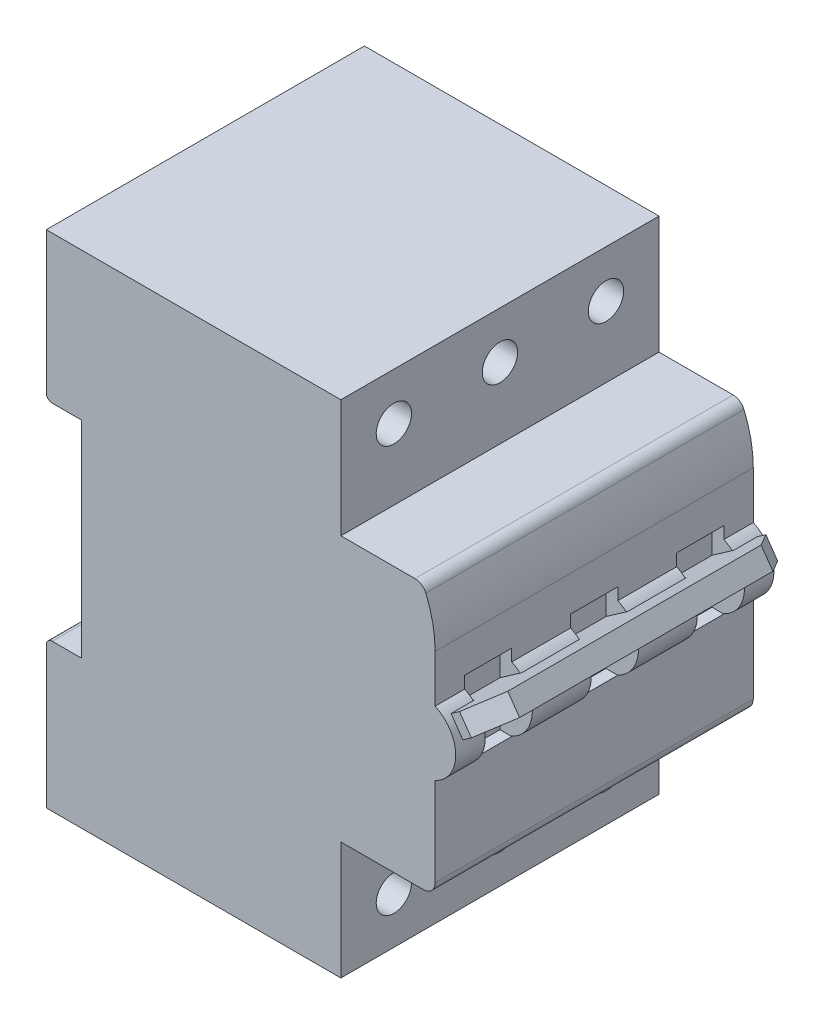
ISO-10303-21;
HEADER;
FILE_DESCRIPTION(('STEP AP214'),'2;1');
FILE_NAME('part.step','',(''),(''),'','','');
FILE_SCHEMA(('AUTOMOTIVE_DESIGN { 1 0 10303 214 1 1 1 1 }'));
ENDSEC;
DATA;
#1=APPLICATION_CONTEXT('core data for automotive mechanical design processes');
#2=APPLICATION_PROTOCOL_DEFINITION('international standard','automotive_design',2000,#1);
#3=PRODUCT_CONTEXT('',#1,'mechanical');
#4=PRODUCT('Part','Part','',(#3));
#5=PRODUCT_RELATED_PRODUCT_CATEGORY('part','',(#4));
#6=PRODUCT_DEFINITION_FORMATION('','',#4);
#7=PRODUCT_DEFINITION_CONTEXT('part definition',#1,'design');
#8=PRODUCT_DEFINITION('design','',#6,#7);
#9=PRODUCT_DEFINITION_SHAPE('','',#8);
#10=(LENGTH_UNIT() NAMED_UNIT(*) SI_UNIT(.MILLI.,.METRE.));
#11=(NAMED_UNIT(*) PLANE_ANGLE_UNIT() SI_UNIT($,.RADIAN.));
#12=(NAMED_UNIT(*) SI_UNIT($,.STERADIAN.) SOLID_ANGLE_UNIT());
#13=UNCERTAINTY_MEASURE_WITH_UNIT(LENGTH_MEASURE(1.E-05),#10,'distance_accuracy_value','');
#14=(GEOMETRIC_REPRESENTATION_CONTEXT(3) GLOBAL_UNCERTAINTY_ASSIGNED_CONTEXT((#13)) GLOBAL_UNIT_ASSIGNED_CONTEXT((#10,
#11,#12)) REPRESENTATION_CONTEXT('',''));
#15=CARTESIAN_POINT('',(0.,0.,0.));
#16=DIRECTION('',(0.,0.,1.));
#17=DIRECTION('',(1.,0.,0.));
#18=AXIS2_PLACEMENT_3D('',#15,#16,#17);
#19=CARTESIAN_POINT('',(63.,1.00000000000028,13.));
#20=DIRECTION('',(0.,0.,1.));
#21=DIRECTION('',(1.,0.,0.));
#22=AXIS2_PLACEMENT_3D('',#19,#20,#21);
#23=PLANE('',#22);
#24=DIRECTION('',(-0.819152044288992,-0.573576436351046,0.));
#25=VECTOR('',#24,1.);
#26=CARTESIAN_POINT('',(61.7063654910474,4.73158058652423,13.));
#27=LINE('',#26,#25);
#28=CARTESIAN_POINT('',(61.4272587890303,4.536147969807,13.));
#29=VERTEX_POINT('',#28);
#30=CARTESIAN_POINT('',(58.,2.13635553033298,13.));
#31=VERTEX_POINT('',#30);
#32=EDGE_CURVE('E463',#29,#31,#27,.T.);
#33=ORIENTED_EDGE('',*,*,#32,.T.);
#34=DIRECTION('',(0.,1.,0.));
#35=VECTOR('',#34,1.);
#36=CARTESIAN_POINT('',(58.,1.00000000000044,13.));
#37=LINE('',#36,#35);
#38=CARTESIAN_POINT('',(58.,7.50000000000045,13.));
#39=VERTEX_POINT('',#38);
#40=EDGE_CURVE('E737',#31,#39,#37,.T.);
#41=ORIENTED_EDGE('',*,*,#40,.T.);
#42=DIRECTION('',(1.,0.,0.));
#43=VECTOR('',#42,1.);
#44=CARTESIAN_POINT('',(63.,7.50000000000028,13.));
#45=LINE('',#44,#43);
#46=CARTESIAN_POINT('',(60.,7.50000000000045,13.));
#47=VERTEX_POINT('',#46);
#48=EDGE_CURVE('E733',#39,#47,#45,.T.);
#49=ORIENTED_EDGE('',*,*,#48,.T.);
#50=DIRECTION('',(0.,-1.,0.));
#51=VECTOR('',#50,1.);
#52=CARTESIAN_POINT('',(60.,13.5,13.));
#53=LINE('',#52,#51);
#54=CARTESIAN_POINT('',(60.,5.45435605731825,13.));
#55=VERTEX_POINT('',#54);
#56=EDGE_CURVE('E970',#47,#55,#53,.T.);
#57=ORIENTED_EDGE('',*,*,#56,.T.);
#58=CARTESIAN_POINT('',(57.5,0.,13.));
#59=DIRECTION('',(0.,0.,1.));
#60=DIRECTION('',(1.,0.,0.));
#61=AXIS2_PLACEMENT_3D('',#58,#59,#60);
#62=CIRCLE('',#61,6.);
#63=EDGE_CURVE('E34',#29,#55,#62,.T.);
#64=ORIENTED_EDGE('',*,*,#63,.F.);
#65=EDGE_LOOP('',(#33,#41,#49,#57,#64));
#66=FACE_BOUND('',#65,.T.);
#67=ADVANCED_FACE('F16',(#66),#23,.F.);
#68=CARTESIAN_POINT('',(58.,1.00000000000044,5.));
#69=DIRECTION('',(-1.,0.,0.));
#70=DIRECTION('',(0.,0.,1.));
#71=AXIS2_PLACEMENT_3D('',#68,#69,#70);
#72=PLANE('',#71);
#73=DIRECTION('',(0.,0.,1.));
#74=VECTOR('',#73,1.);
#75=CARTESIAN_POINT('',(58.,2.13635553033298,5.));
#76=LINE('',#75,#74);
#77=CARTESIAN_POINT('',(58.,2.13635553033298,5.));
#78=VERTEX_POINT('',#77);
#79=EDGE_CURVE('E591',#78,#31,#76,.T.);
#80=ORIENTED_EDGE('',*,*,#79,.F.);
#81=DIRECTION('',(0.,-1.,0.));
#82=VECTOR('',#81,1.);
#83=CARTESIAN_POINT('',(58.,1.00000000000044,5.));
#84=LINE('',#83,#82);
#85=CARTESIAN_POINT('',(58.,7.50000000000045,5.));
#86=VERTEX_POINT('',#85);
#87=EDGE_CURVE('E723',#86,#78,#84,.T.);
#88=ORIENTED_EDGE('',*,*,#87,.F.);
#89=DIRECTION('',(0.,0.,1.));
#90=VECTOR('',#89,1.);
#91=CARTESIAN_POINT('',(58.,7.50000000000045,5.));
#92=LINE('',#91,#90);
#93=EDGE_CURVE('E722',#86,#39,#92,.T.);
#94=ORIENTED_EDGE('',*,*,#93,.T.);
#95=ORIENTED_EDGE('',*,*,#40,.F.);
#96=EDGE_LOOP('',(#80,#88,#94,#95));
#97=FACE_BOUND('',#96,.T.);
#98=ADVANCED_FACE('F1073',(#97),#72,.F.);
#99=CARTESIAN_POINT('',(63.,1.00000000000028,5.));
#100=DIRECTION('',(0.,0.,-1.));
#101=DIRECTION('',(-1.,0.,0.));
#102=AXIS2_PLACEMENT_3D('',#99,#100,#101);
#103=PLANE('',#102);
#104=DIRECTION('',(-0.819152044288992,-0.573576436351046,0.));
#105=VECTOR('',#104,1.);
#106=CARTESIAN_POINT('',(61.7063654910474,4.73158058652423,5.));
#107=LINE('',#106,#105);
#108=CARTESIAN_POINT('',(61.4272587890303,4.536147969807,5.));
#109=VERTEX_POINT('',#108);
#110=EDGE_CURVE('E458',#109,#78,#107,.T.);
#111=ORIENTED_EDGE('',*,*,#110,.F.);
#112=CARTESIAN_POINT('',(57.5,0.,5.));
#113=DIRECTION('',(0.,0.,-1.));
#114=DIRECTION('',(-1.,0.,0.));
#115=AXIS2_PLACEMENT_3D('',#112,#113,#114);
#116=CIRCLE('',#115,6.);
#117=CARTESIAN_POINT('',(60.,5.45435605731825,5.));
#118=VERTEX_POINT('',#117);
#119=EDGE_CURVE('E745',#118,#109,#116,.T.);
#120=ORIENTED_EDGE('',*,*,#119,.F.);
#121=DIRECTION('',(0.,1.,0.));
#122=VECTOR('',#121,1.);
#123=CARTESIAN_POINT('',(60.,13.5,5.));
#124=LINE('',#123,#122);
#125=CARTESIAN_POINT('',(60.,7.50000000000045,5.));
#126=VERTEX_POINT('',#125);
#127=EDGE_CURVE('E897',#118,#126,#124,.T.);
#128=ORIENTED_EDGE('',*,*,#127,.T.);
#129=DIRECTION('',(-1.,0.,0.));
#130=VECTOR('',#129,1.);
#131=CARTESIAN_POINT('',(63.,7.50000000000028,5.));
#132=LINE('',#131,#130);
#133=EDGE_CURVE('E719',#126,#86,#132,.T.);
#134=ORIENTED_EDGE('',*,*,#133,.T.);
#135=ORIENTED_EDGE('',*,*,#87,.T.);
#136=EDGE_LOOP('',(#111,#120,#128,#134,#135));
#137=FACE_BOUND('',#136,.T.);
#138=ADVANCED_FACE('F1079',(#137),#103,.F.);
#139=CARTESIAN_POINT('',(63.,1.00000000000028,31.));
#140=DIRECTION('',(0.,0.,1.));
#141=DIRECTION('',(1.,0.,0.));
#142=AXIS2_PLACEMENT_3D('',#139,#140,#141);
#143=PLANE('',#142);
#144=DIRECTION('',(-0.819152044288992,-0.573576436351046,0.));
#145=VECTOR('',#144,1.);
#146=CARTESIAN_POINT('',(61.7063654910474,4.73158058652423,31.));
#147=LINE('',#146,#145);
#148=CARTESIAN_POINT('',(61.4272587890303,4.536147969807,31.));
#149=VERTEX_POINT('',#148);
#150=CARTESIAN_POINT('',(58.,2.13635553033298,31.));
#151=VERTEX_POINT('',#150);
#152=EDGE_CURVE('E476',#149,#151,#147,.T.);
#153=ORIENTED_EDGE('',*,*,#152,.T.);
#154=DIRECTION('',(0.,1.,0.));
#155=VECTOR('',#154,1.);
#156=CARTESIAN_POINT('',(58.,1.00000000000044,31.));
#157=LINE('',#156,#155);
#158=CARTESIAN_POINT('',(58.,7.50000000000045,31.));
#159=VERTEX_POINT('',#158);
#160=EDGE_CURVE('E688',#151,#159,#157,.T.);
#161=ORIENTED_EDGE('',*,*,#160,.T.);
#162=DIRECTION('',(1.,0.,0.));
#163=VECTOR('',#162,1.);
#164=CARTESIAN_POINT('',(63.,7.50000000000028,31.));
#165=LINE('',#164,#163);
#166=CARTESIAN_POINT('',(60.,7.50000000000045,31.));
#167=VERTEX_POINT('',#166);
#168=EDGE_CURVE('E684',#159,#167,#165,.T.);
#169=ORIENTED_EDGE('',*,*,#168,.T.);
#170=DIRECTION('',(0.,-1.,0.));
#171=VECTOR('',#170,1.);
#172=CARTESIAN_POINT('',(60.,13.5,31.));
#173=LINE('',#172,#171);
#174=CARTESIAN_POINT('',(60.,5.45435605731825,31.));
#175=VERTEX_POINT('',#174);
#176=EDGE_CURVE('E982',#167,#175,#173,.T.);
#177=ORIENTED_EDGE('',*,*,#176,.T.);
#178=CARTESIAN_POINT('',(57.5,0.,31.));
#179=DIRECTION('',(0.,0.,1.));
#180=DIRECTION('',(1.,0.,0.));
#181=AXIS2_PLACEMENT_3D('',#178,#179,#180);
#182=CIRCLE('',#181,6.);
#183=EDGE_CURVE('E706',#149,#175,#182,.T.);
#184=ORIENTED_EDGE('',*,*,#183,.F.);
#185=EDGE_LOOP('',(#153,#161,#169,#177,#184));
#186=FACE_BOUND('',#185,.T.);
#187=ADVANCED_FACE('F1161',(#186),#143,.F.);
#188=CARTESIAN_POINT('',(58.,1.00000000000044,23.));
#189=DIRECTION('',(-1.,0.,0.));
#190=DIRECTION('',(0.,0.,1.));
#191=AXIS2_PLACEMENT_3D('',#188,#189,#190);
#192=PLANE('',#191);
#193=DIRECTION('',(0.,0.,1.));
#194=VECTOR('',#193,1.);
#195=CARTESIAN_POINT('',(58.,2.13635553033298,23.));
#196=LINE('',#195,#194);
#197=CARTESIAN_POINT('',(58.,2.13635553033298,23.));
#198=VERTEX_POINT('',#197);
#199=EDGE_CURVE('E587',#198,#151,#196,.T.);
#200=ORIENTED_EDGE('',*,*,#199,.F.);
#201=DIRECTION('',(0.,-1.,0.));
#202=VECTOR('',#201,1.);
#203=CARTESIAN_POINT('',(58.,1.00000000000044,23.));
#204=LINE('',#203,#202);
#205=CARTESIAN_POINT('',(58.,7.50000000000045,23.));
#206=VERTEX_POINT('',#205);
#207=EDGE_CURVE('E674',#206,#198,#204,.T.);
#208=ORIENTED_EDGE('',*,*,#207,.F.);
#209=DIRECTION('',(0.,0.,1.));
#210=VECTOR('',#209,1.);
#211=CARTESIAN_POINT('',(58.,7.50000000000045,23.));
#212=LINE('',#211,#210);
#213=EDGE_CURVE('E673',#206,#159,#212,.T.);
#214=ORIENTED_EDGE('',*,*,#213,.T.);
#215=ORIENTED_EDGE('',*,*,#160,.F.);
#216=EDGE_LOOP('',(#200,#208,#214,#215));
#217=FACE_BOUND('',#216,.T.);
#218=ADVANCED_FACE('F1190',(#217),#192,.F.);
#219=CARTESIAN_POINT('',(63.,1.00000000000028,23.));
#220=DIRECTION('',(0.,0.,-1.));
#221=DIRECTION('',(-1.,0.,0.));
#222=AXIS2_PLACEMENT_3D('',#219,#220,#221);
#223=PLANE('',#222);
#224=DIRECTION('',(-0.819152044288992,-0.573576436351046,0.));
#225=VECTOR('',#224,1.);
#226=CARTESIAN_POINT('',(61.7063654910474,4.73158058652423,23.));
#227=LINE('',#226,#225);
#228=CARTESIAN_POINT('',(61.4272587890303,4.536147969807,23.));
#229=VERTEX_POINT('',#228);
#230=EDGE_CURVE('E471',#229,#198,#227,.T.);
#231=ORIENTED_EDGE('',*,*,#230,.F.);
#232=CARTESIAN_POINT('',(57.5,0.,23.));
#233=DIRECTION('',(0.,0.,-1.));
#234=DIRECTION('',(-1.,0.,0.));
#235=AXIS2_PLACEMENT_3D('',#232,#233,#234);
#236=CIRCLE('',#235,6.);
#237=CARTESIAN_POINT('',(60.,5.45435605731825,23.));
#238=VERTEX_POINT('',#237);
#239=EDGE_CURVE('E697',#238,#229,#236,.T.);
#240=ORIENTED_EDGE('',*,*,#239,.F.);
#241=DIRECTION('',(0.,1.,0.));
#242=VECTOR('',#241,1.);
#243=CARTESIAN_POINT('',(60.,13.5,23.));
#244=LINE('',#243,#242);
#245=CARTESIAN_POINT('',(60.,7.50000000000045,23.));
#246=VERTEX_POINT('',#245);
#247=EDGE_CURVE('E976',#238,#246,#244,.T.);
#248=ORIENTED_EDGE('',*,*,#247,.T.);
#249=DIRECTION('',(-1.,0.,0.));
#250=VECTOR('',#249,1.);
#251=CARTESIAN_POINT('',(63.,7.50000000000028,23.));
#252=LINE('',#251,#250);
#253=EDGE_CURVE('E670',#246,#206,#252,.T.);
#254=ORIENTED_EDGE('',*,*,#253,.T.);
#255=ORIENTED_EDGE('',*,*,#207,.T.);
#256=EDGE_LOOP('',(#231,#240,#248,#254,#255));
#257=FACE_BOUND('',#256,.T.);
#258=ADVANCED_FACE('F1214',(#257),#223,.F.);
#259=CARTESIAN_POINT('',(63.,1.00000000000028,49.));
#260=DIRECTION('',(0.,0.,1.));
#261=DIRECTION('',(1.,0.,0.));
#262=AXIS2_PLACEMENT_3D('',#259,#260,#261);
#263=PLANE('',#262);
#264=DIRECTION('',(-0.819152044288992,-0.573576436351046,0.));
#265=VECTOR('',#264,1.);
#266=CARTESIAN_POINT('',(61.7063654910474,4.73158058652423,49.));
#267=LINE('',#266,#265);
#268=CARTESIAN_POINT('',(61.4272587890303,4.536147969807,49.));
#269=VERTEX_POINT('',#268);
#270=CARTESIAN_POINT('',(58.,2.13635553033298,49.));
#271=VERTEX_POINT('',#270);
#272=EDGE_CURVE('E488',#269,#271,#267,.T.);
#273=ORIENTED_EDGE('',*,*,#272,.T.);
#274=DIRECTION('',(0.,1.,0.));
#275=VECTOR('',#274,1.);
#276=CARTESIAN_POINT('',(58.,1.00000000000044,49.));
#277=LINE('',#276,#275);
#278=CARTESIAN_POINT('',(58.,7.50000000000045,49.));
#279=VERTEX_POINT('',#278);
#280=EDGE_CURVE('E639',#271,#279,#277,.T.);
#281=ORIENTED_EDGE('',*,*,#280,.T.);
#282=DIRECTION('',(1.,0.,0.));
#283=VECTOR('',#282,1.);
#284=CARTESIAN_POINT('',(62.9999999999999,7.50000000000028,49.));
#285=LINE('',#284,#283);
#286=CARTESIAN_POINT('',(60.,7.50000000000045,49.));
#287=VERTEX_POINT('',#286);
#288=EDGE_CURVE('E635',#279,#287,#285,.T.);
#289=ORIENTED_EDGE('',*,*,#288,.T.);
#290=DIRECTION('',(0.,-1.,0.));
#291=VECTOR('',#290,1.);
#292=CARTESIAN_POINT('',(60.,13.5,49.));
#293=LINE('',#292,#291);
#294=CARTESIAN_POINT('',(60.,5.45435605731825,49.));
#295=VERTEX_POINT('',#294);
#296=EDGE_CURVE('E995',#287,#295,#293,.T.);
#297=ORIENTED_EDGE('',*,*,#296,.T.);
#298=CARTESIAN_POINT('',(57.5,0.,49.));
#299=DIRECTION('',(0.,0.,1.));
#300=DIRECTION('',(1.,0.,0.));
#301=AXIS2_PLACEMENT_3D('',#298,#299,#300);
#302=CIRCLE('',#301,6.);
#303=EDGE_CURVE('E657',#269,#295,#302,.T.);
#304=ORIENTED_EDGE('',*,*,#303,.F.);
#305=EDGE_LOOP('',(#273,#281,#289,#297,#304));
#306=FACE_BOUND('',#305,.T.);
#307=ADVANCED_FACE('F1226',(#306),#263,.F.);
#308=CARTESIAN_POINT('',(58.,1.00000000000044,41.));
#309=DIRECTION('',(-1.,0.,0.));
#310=DIRECTION('',(0.,0.,1.));
#311=AXIS2_PLACEMENT_3D('',#308,#309,#310);
#312=PLANE('',#311);
#313=DIRECTION('',(0.,0.,1.));
#314=VECTOR('',#313,1.);
#315=CARTESIAN_POINT('',(58.,2.13635553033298,41.));
#316=LINE('',#315,#314);
#317=CARTESIAN_POINT('',(58.,2.13635553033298,41.));
#318=VERTEX_POINT('',#317);
#319=EDGE_CURVE('E550',#318,#271,#316,.T.);
#320=ORIENTED_EDGE('',*,*,#319,.F.);
#321=DIRECTION('',(0.,-1.,0.));
#322=VECTOR('',#321,1.);
#323=CARTESIAN_POINT('',(58.,1.00000000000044,41.));
#324=LINE('',#323,#322);
#325=CARTESIAN_POINT('',(58.,7.50000000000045,41.));
#326=VERTEX_POINT('',#325);
#327=EDGE_CURVE('E625',#326,#318,#324,.T.);
#328=ORIENTED_EDGE('',*,*,#327,.F.);
#329=DIRECTION('',(0.,0.,1.));
#330=VECTOR('',#329,1.);
#331=CARTESIAN_POINT('',(58.,7.50000000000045,41.));
#332=LINE('',#331,#330);
#333=EDGE_CURVE('E624',#326,#279,#332,.T.);
#334=ORIENTED_EDGE('',*,*,#333,.T.);
#335=ORIENTED_EDGE('',*,*,#280,.F.);
#336=EDGE_LOOP('',(#320,#328,#334,#335));
#337=FACE_BOUND('',#336,.T.);
#338=ADVANCED_FACE('F1255',(#337),#312,.F.);
#339=CARTESIAN_POINT('',(63.,1.00000000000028,41.));
#340=DIRECTION('',(0.,0.,-1.));
#341=DIRECTION('',(-1.,0.,0.));
#342=AXIS2_PLACEMENT_3D('',#339,#340,#341);
#343=PLANE('',#342);
#344=DIRECTION('',(-0.819152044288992,-0.573576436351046,0.));
#345=VECTOR('',#344,1.);
#346=CARTESIAN_POINT('',(60.8211379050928,4.11173755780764,41.));
#347=LINE('',#346,#345);
#348=CARTESIAN_POINT('',(61.4272587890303,4.536147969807,41.));
#349=VERTEX_POINT('',#348);
#350=EDGE_CURVE('E26',#349,#318,#347,.T.);
#351=ORIENTED_EDGE('',*,*,#350,.F.);
#352=CARTESIAN_POINT('',(57.5,0.,41.));
#353=DIRECTION('',(0.,0.,-1.));
#354=DIRECTION('',(-1.,0.,0.));
#355=AXIS2_PLACEMENT_3D('',#352,#353,#354);
#356=CIRCLE('',#355,6.);
#357=CARTESIAN_POINT('',(60.,5.45435605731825,41.));
#358=VERTEX_POINT('',#357);
#359=EDGE_CURVE('E648',#358,#349,#356,.T.);
#360=ORIENTED_EDGE('',*,*,#359,.F.);
#361=DIRECTION('',(0.,1.,0.));
#362=VECTOR('',#361,1.);
#363=CARTESIAN_POINT('',(60.,13.5,41.));
#364=LINE('',#363,#362);
#365=CARTESIAN_POINT('',(60.,7.50000000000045,41.));
#366=VERTEX_POINT('',#365);
#367=EDGE_CURVE('E989',#358,#366,#364,.T.);
#368=ORIENTED_EDGE('',*,*,#367,.T.);
#369=DIRECTION('',(-1.,0.,0.));
#370=VECTOR('',#369,1.);
#371=CARTESIAN_POINT('',(63.,7.50000000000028,41.));
#372=LINE('',#371,#370);
#373=EDGE_CURVE('E621',#366,#326,#372,.T.);
#374=ORIENTED_EDGE('',*,*,#373,.T.);
#375=ORIENTED_EDGE('',*,*,#327,.T.);
#376=EDGE_LOOP('',(#351,#360,#368,#374,#375));
#377=FACE_BOUND('',#376,.T.);
#378=ADVANCED_FACE('F1278',(#377),#343,.F.);
#379=CARTESIAN_POINT('',(57.5,0.,54.));
#380=DIRECTION('',(0.,0.,-1.));
#381=DIRECTION('',(-1.,0.,0.));
#382=AXIS2_PLACEMENT_3D('',#379,#380,#381);
#383=CYLINDRICAL_SURFACE('',#382,6.);
#384=DIRECTION('',(0.,0.,-1.));
#385=VECTOR('',#384,1.);
#386=CARTESIAN_POINT('',(60.,-5.45435605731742,54.));
#387=LINE('',#386,#385);
#388=CARTESIAN_POINT('',(60.,-5.45435605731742,54.));
#389=VERTEX_POINT('',#388);
#390=CARTESIAN_POINT('',(60.,-5.45435605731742,49.));
#391=VERTEX_POINT('',#390);
#392=EDGE_CURVE('E919',#389,#391,#387,.T.);
#393=ORIENTED_EDGE('',*,*,#392,.T.);
#394=CARTESIAN_POINT('',(63.2913125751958,1.56866142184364,49.));
#395=VERTEX_POINT('',#394);
#396=EDGE_CURVE('E658',#391,#395,#302,.T.);
#397=ORIENTED_EDGE('',*,*,#396,.T.);
#398=CARTESIAN_POINT('',(57.5,0.,49.));
#399=DIRECTION('',(0.,0.,-1.));
#400=DIRECTION('',(0.,1.,0.));
#401=AXIS2_PLACEMENT_3D('',#398,#399,#400);
#402=CIRCLE('',#401,6.);
#403=EDGE_CURVE('E604',#269,#395,#402,.T.);
#404=ORIENTED_EDGE('',*,*,#403,.F.);
#405=ORIENTED_EDGE('',*,*,#303,.T.);
#406=DIRECTION('',(0.,0.,-1.));
#407=VECTOR('',#406,1.);
#408=CARTESIAN_POINT('',(60.,5.45435605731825,54.));
#409=LINE('',#408,#407);
#410=CARTESIAN_POINT('',(60.,5.45435605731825,54.));
#411=VERTEX_POINT('',#410);
#412=EDGE_CURVE('E925',#411,#295,#409,.T.);
#413=ORIENTED_EDGE('',*,*,#412,.F.);
#414=CARTESIAN_POINT('',(57.5,0.,54.));
#415=DIRECTION('',(0.,0.,1.));
#416=DIRECTION('',(1.,0.,0.));
#417=AXIS2_PLACEMENT_3D('',#414,#415,#416);
#418=CIRCLE('',#417,6.);
#419=EDGE_CURVE('E864',#389,#411,#418,.T.);
#420=ORIENTED_EDGE('',*,*,#419,.F.);
#421=EDGE_LOOP('',(#393,#397,#404,#405,#413,#420));
#422=FACE_BOUND('',#421,.T.);
#423=ADVANCED_FACE('F1728',(#422),#383,.T.);
#424=EDGE_CURVE('E929',#358,#175,#409,.T.);
#425=ORIENTED_EDGE('',*,*,#424,.F.);
#426=ORIENTED_EDGE('',*,*,#359,.T.);
#427=CARTESIAN_POINT('',(63.2913125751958,1.56866142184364,41.));
#428=VERTEX_POINT('',#427);
#429=EDGE_CURVE('E653',#349,#428,#356,.T.);
#430=ORIENTED_EDGE('',*,*,#429,.T.);
#431=CARTESIAN_POINT('',(60.,-5.45435605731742,41.));
#432=VERTEX_POINT('',#431);
#433=EDGE_CURVE('E647',#428,#432,#356,.T.);
#434=ORIENTED_EDGE('',*,*,#433,.T.);
#435=CARTESIAN_POINT('',(60.,-5.45435605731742,31.));
#436=VERTEX_POINT('',#435);
#437=EDGE_CURVE('E923',#432,#436,#387,.T.);
#438=ORIENTED_EDGE('',*,*,#437,.T.);
#439=CARTESIAN_POINT('',(63.2913125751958,1.56866142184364,31.));
#440=VERTEX_POINT('',#439);
#441=EDGE_CURVE('E707',#436,#440,#182,.T.);
#442=ORIENTED_EDGE('',*,*,#441,.T.);
#443=CARTESIAN_POINT('',(57.5,0.,31.));
#444=DIRECTION('',(0.,0.,-1.));
#445=DIRECTION('',(0.,1.,0.));
#446=AXIS2_PLACEMENT_3D('',#443,#444,#445);
#447=CIRCLE('',#446,6.);
#448=EDGE_CURVE('E608',#149,#440,#447,.T.);
#449=ORIENTED_EDGE('',*,*,#448,.F.);
#450=ORIENTED_EDGE('',*,*,#183,.T.);
#451=EDGE_LOOP('',(#425,#426,#430,#434,#438,#442,#449,#450));
#452=FACE_BOUND('',#451,.T.);
#453=ADVANCED_FACE('F1745',(#452),#383,.T.);
#454=EDGE_CURVE('E1716',#238,#55,#409,.T.);
#455=ORIENTED_EDGE('',*,*,#454,.F.);
#456=ORIENTED_EDGE('',*,*,#239,.T.);
#457=CARTESIAN_POINT('',(63.2913125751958,1.56866142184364,23.));
#458=VERTEX_POINT('',#457);
#459=EDGE_CURVE('E702',#229,#458,#236,.T.);
#460=ORIENTED_EDGE('',*,*,#459,.T.);
#461=CARTESIAN_POINT('',(60.,-5.45435605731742,23.));
#462=VERTEX_POINT('',#461);
#463=EDGE_CURVE('E696',#458,#462,#236,.T.);
#464=ORIENTED_EDGE('',*,*,#463,.T.);
#465=CARTESIAN_POINT('',(60.,-5.45435605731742,13.));
#466=VERTEX_POINT('',#465);
#467=EDGE_CURVE('E1785',#462,#466,#387,.T.);
#468=ORIENTED_EDGE('',*,*,#467,.T.);
#469=CARTESIAN_POINT('',(63.2913125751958,1.56866142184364,13.));
#470=VERTEX_POINT('',#469);
#471=EDGE_CURVE('E754',#466,#470,#62,.T.);
#472=ORIENTED_EDGE('',*,*,#471,.T.);
#473=CARTESIAN_POINT('',(57.5,0.,13.));
#474=DIRECTION('',(0.,0.,-1.));
#475=DIRECTION('',(0.,1.,0.));
#476=AXIS2_PLACEMENT_3D('',#473,#474,#475);
#477=CIRCLE('',#476,6.);
#478=EDGE_CURVE('E612',#29,#470,#477,.T.);
#479=ORIENTED_EDGE('',*,*,#478,.F.);
#480=ORIENTED_EDGE('',*,*,#63,.T.);
#481=EDGE_LOOP('',(#455,#456,#460,#464,#468,#472,#479,#480));
#482=FACE_BOUND('',#481,.T.);
#483=ADVANCED_FACE('F1786',(#482),#383,.T.);
#484=CARTESIAN_POINT('',(0.,-17.5,54.));
#485=DIRECTION('',(0.,-1.,0.));
#486=DIRECTION('',(1.,0.,0.));
#487=AXIS2_PLACEMENT_3D('',#484,#485,#486);
#488=PLANE('',#487);
#489=DIRECTION('',(-1.,0.,0.));
#490=VECTOR('',#489,1.);
#491=CARTESIAN_POINT('',(0.,-17.5,0.));
#492=LINE('',#491,#490);
#493=CARTESIAN_POINT('',(0.,-17.5,0.));
#494=VERTEX_POINT('',#493);
#495=CARTESIAN_POINT('',(-5.,-17.5000000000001,0.));
#496=VERTEX_POINT('',#495);
#497=EDGE_CURVE('E760',#494,#496,#492,.T.);
#498=ORIENTED_EDGE('',*,*,#497,.T.);
#499=DIRECTION('',(0.,0.,-1.));
#500=VECTOR('',#499,1.);
#501=CARTESIAN_POINT('',(-5.,-17.5000000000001,54.));
#502=LINE('',#501,#500);
#503=CARTESIAN_POINT('',(-5.,-17.5000000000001,54.));
#504=VERTEX_POINT('',#503);
#505=EDGE_CURVE('E893',#504,#496,#502,.T.);
#506=ORIENTED_EDGE('',*,*,#505,.F.);
#507=DIRECTION('',(-1.,0.,0.));
#508=VECTOR('',#507,1.);
#509=CARTESIAN_POINT('',(0.,-17.5,54.));
#510=LINE('',#509,#508);
#511=CARTESIAN_POINT('',(0.,-17.5,54.));
#512=VERTEX_POINT('',#511);
#513=EDGE_CURVE('E764',#512,#504,#510,.T.);
#514=ORIENTED_EDGE('',*,*,#513,.F.);
#515=DIRECTION('',(0.,0.,-1.));
#516=VECTOR('',#515,1.);
#517=CARTESIAN_POINT('',(0.,-17.5,54.));
#518=LINE('',#517,#516);
#519=EDGE_CURVE('E832',#512,#494,#518,.T.);
#520=ORIENTED_EDGE('',*,*,#519,.T.);
#521=EDGE_LOOP('',(#498,#506,#514,#520));
#522=FACE_BOUND('',#521,.T.);
#523=ADVANCED_FACE('F18',(#522),#488,.F.);
#524=CARTESIAN_POINT('',(-5.,-18.5000000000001,54.));
#525=DIRECTION('',(0.,0.,-1.));
#526=DIRECTION('',(-1.,0.,0.));
#527=AXIS2_PLACEMENT_3D('',#524,#525,#526);
#528=CYLINDRICAL_SURFACE('',#527,1.);
#529=CARTESIAN_POINT('',(-5.,-18.5000000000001,0.));
#530=DIRECTION('',(0.,0.,1.));
#531=DIRECTION('',(1.,0.,0.));
#532=AXIS2_PLACEMENT_3D('',#529,#530,#531);
#533=CIRCLE('',#532,1.);
#534=CARTESIAN_POINT('',(-6.00000000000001,-18.5,0.));
#535=VERTEX_POINT('',#534);
#536=EDGE_CURVE('E823',#496,#535,#533,.T.);
#537=ORIENTED_EDGE('',*,*,#536,.T.);
#538=DIRECTION('',(0.,0.,-1.));
#539=VECTOR('',#538,1.);
#540=CARTESIAN_POINT('',(-6.00000000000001,-18.5,54.));
#541=LINE('',#540,#539);
#542=CARTESIAN_POINT('',(-6.00000000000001,-18.5,54.));
#543=VERTEX_POINT('',#542);
#544=EDGE_CURVE('E898',#543,#535,#541,.T.);
#545=ORIENTED_EDGE('',*,*,#544,.F.);
#546=CARTESIAN_POINT('',(-5.,-18.5000000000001,54.));
#547=DIRECTION('',(0.,0.,1.));
#548=DIRECTION('',(1.,0.,0.));
#549=AXIS2_PLACEMENT_3D('',#546,#547,#548);
#550=CIRCLE('',#549,1.);
#551=EDGE_CURVE('E887',#504,#543,#550,.T.);
#552=ORIENTED_EDGE('',*,*,#551,.F.);
#553=ORIENTED_EDGE('',*,*,#505,.T.);
#554=EDGE_LOOP('',(#537,#545,#552,#553));
#555=FACE_BOUND('',#554,.T.);
#556=ADVANCED_FACE('F1661',(#555),#528,.T.);
#557=CARTESIAN_POINT('',(-6.00000000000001,-18.5,54.));
#558=DIRECTION('',(1.,0.,0.));
#559=DIRECTION('',(0.,0.,-1.));
#560=AXIS2_PLACEMENT_3D('',#557,#558,#559);
#561=PLANE('',#560);
#562=DIRECTION('',(0.,-1.,0.));
#563=VECTOR('',#562,1.);
#564=CARTESIAN_POINT('',(-6.00000000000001,-18.5,0.));
#565=LINE('',#564,#563);
#566=CARTESIAN_POINT('',(-6.00000000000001,-42.5000000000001,0.));
#567=VERTEX_POINT('',#566);
#568=EDGE_CURVE('E820',#535,#567,#565,.T.);
#569=ORIENTED_EDGE('',*,*,#568,.T.);
#570=DIRECTION('',(0.,0.,-1.));
#571=VECTOR('',#570,1.);
#572=CARTESIAN_POINT('',(-6.00000000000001,-42.5000000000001,54.));
#573=LINE('',#572,#571);
#574=CARTESIAN_POINT('',(-6.00000000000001,-42.5000000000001,54.));
#575=VERTEX_POINT('',#574);
#576=EDGE_CURVE('E902',#575,#567,#573,.T.);
#577=ORIENTED_EDGE('',*,*,#576,.F.);
#578=DIRECTION('',(0.,-1.,0.));
#579=VECTOR('',#578,1.);
#580=CARTESIAN_POINT('',(-6.00000000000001,-18.5,54.));
#581=LINE('',#580,#579);
#582=EDGE_CURVE('E884',#543,#575,#581,.T.);
#583=ORIENTED_EDGE('',*,*,#582,.F.);
#584=ORIENTED_EDGE('',*,*,#544,.T.);
#585=EDGE_LOOP('',(#569,#577,#583,#584));
#586=FACE_BOUND('',#585,.T.);
#587=ADVANCED_FACE('F1656',(#586),#561,.F.);
#588=CARTESIAN_POINT('',(-6.00000000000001,-42.5000000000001,54.));
#589=DIRECTION('',(0.,1.,0.));
#590=DIRECTION('',(0.,0.,1.));
#591=AXIS2_PLACEMENT_3D('',#588,#589,#590);
#592=PLANE('',#591);
#593=DIRECTION('',(1.,0.,0.));
#594=VECTOR('',#593,1.);
#595=CARTESIAN_POINT('',(-6.00000000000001,-42.5000000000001,0.));
#596=LINE('',#595,#594);
#597=CARTESIAN_POINT('',(44.,-42.4999999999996,0.));
#598=VERTEX_POINT('',#597);
#599=EDGE_CURVE('E816',#567,#598,#596,.T.);
#600=ORIENTED_EDGE('',*,*,#599,.T.);
#601=DIRECTION('',(0.,0.,-1.));
#602=VECTOR('',#601,1.);
#603=CARTESIAN_POINT('',(44.,-42.4999999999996,54.));
#604=LINE('',#603,#602);
#605=CARTESIAN_POINT('',(44.,-42.4999999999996,54.));
#606=VERTEX_POINT('',#605);
#607=EDGE_CURVE('E906',#606,#598,#604,.T.);
#608=ORIENTED_EDGE('',*,*,#607,.F.);
#609=DIRECTION('',(1.,0.,0.));
#610=VECTOR('',#609,1.);
#611=CARTESIAN_POINT('',(-6.00000000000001,-42.5000000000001,54.));
#612=LINE('',#611,#610);
#613=EDGE_CURVE('E881',#575,#606,#612,.T.);
#614=ORIENTED_EDGE('',*,*,#613,.F.);
#615=ORIENTED_EDGE('',*,*,#576,.T.);
#616=EDGE_LOOP('',(#600,#608,#614,#615));
#617=FACE_BOUND('',#616,.T.);
#618=ADVANCED_FACE('F1629',(#617),#592,.F.);
#619=CARTESIAN_POINT('',(44.,-22.4999999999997,54.));
#620=DIRECTION('',(1.,0.,0.));
#621=DIRECTION('',(0.,0.,-1.));
#622=AXIS2_PLACEMENT_3D('',#619,#620,#621);
#623=PLANE('',#622);
#624=CARTESIAN_POINT('',(44.,-34.4999999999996,45.));
#625=DIRECTION('',(1.,0.,0.));
#626=DIRECTION('',(0.,0.,-1.));
#627=AXIS2_PLACEMENT_3D('',#624,#625,#626);
#628=CIRCLE('',#627,3.);
#629=CARTESIAN_POINT('',(44.,-34.4999999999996,42.));
#630=VERTEX_POINT('',#629);
#631=EDGE_CURVE('E20',#630,#630,#628,.T.);
#632=ORIENTED_EDGE('',*,*,#631,.F.);
#633=EDGE_LOOP('',(#632));
#634=FACE_BOUND('',#633,.T.);
#635=CARTESIAN_POINT('',(44.,-34.4999999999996,27.));
#636=DIRECTION('',(1.,0.,0.));
#637=DIRECTION('',(0.,0.,-1.));
#638=AXIS2_PLACEMENT_3D('',#635,#636,#637);
#639=CIRCLE('',#638,3.);
#640=CARTESIAN_POINT('',(44.,-34.4999999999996,24.));
#641=VERTEX_POINT('',#640);
#642=EDGE_CURVE('E1022',#641,#641,#639,.T.);
#643=ORIENTED_EDGE('',*,*,#642,.F.);
#644=EDGE_LOOP('',(#643));
#645=FACE_BOUND('',#644,.T.);
#646=CARTESIAN_POINT('',(44.,-34.4999999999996,9.00000000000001));
#647=DIRECTION('',(1.,0.,0.));
#648=DIRECTION('',(0.,0.,-1.));
#649=AXIS2_PLACEMENT_3D('',#646,#647,#648);
#650=CIRCLE('',#649,3.);
#651=CARTESIAN_POINT('',(44.,-34.4999999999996,6.00000000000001));
#652=VERTEX_POINT('',#651);
#653=EDGE_CURVE('E1018',#652,#652,#650,.T.);
#654=ORIENTED_EDGE('',*,*,#653,.F.);
#655=EDGE_LOOP('',(#654));
#656=FACE_BOUND('',#655,.T.);
#657=DIRECTION('',(0.,-1.,0.));
#658=VECTOR('',#657,1.);
#659=CARTESIAN_POINT('',(44.,-22.4999999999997,0.));
#660=LINE('',#659,#658);
#661=CARTESIAN_POINT('',(44.,-22.4999999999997,0.));
#662=VERTEX_POINT('',#661);
#663=EDGE_CURVE('E812',#662,#598,#660,.T.);
#664=ORIENTED_EDGE('',*,*,#663,.F.);
#665=DIRECTION('',(0.,0.,-1.));
#666=VECTOR('',#665,1.);
#667=CARTESIAN_POINT('',(44.,-22.4999999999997,54.));
#668=LINE('',#667,#666);
#669=CARTESIAN_POINT('',(44.,-22.4999999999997,54.));
#670=VERTEX_POINT('',#669);
#671=EDGE_CURVE('E909',#670,#662,#668,.T.);
#672=ORIENTED_EDGE('',*,*,#671,.F.);
#673=DIRECTION('',(0.,-1.,0.));
#674=VECTOR('',#673,1.);
#675=CARTESIAN_POINT('',(44.,-22.4999999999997,54.));
#676=LINE('',#675,#674);
#677=EDGE_CURVE('E877',#670,#606,#676,.T.);
#678=ORIENTED_EDGE('',*,*,#677,.T.);
#679=ORIENTED_EDGE('',*,*,#607,.T.);
#680=EDGE_LOOP('',(#664,#672,#678,#679));
#681=FACE_BOUND('',#680,.T.);
#682=ADVANCED_FACE('F1625',(#634,#645,#656,#681),#623,.T.);
#683=CARTESIAN_POINT('',(44.,-22.4999999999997,54.));
#684=DIRECTION('',(0.,1.,0.));
#685=DIRECTION('',(-1.,0.,0.));
#686=AXIS2_PLACEMENT_3D('',#683,#684,#685);
#687=PLANE('',#686);
#688=DIRECTION('',(1.,0.,0.));
#689=VECTOR('',#688,1.);
#690=CARTESIAN_POINT('',(44.,-22.4999999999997,0.));
#691=LINE('',#690,#689);
#692=CARTESIAN_POINT('',(58.,-22.4999999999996,0.));
#693=VERTEX_POINT('',#692);
#694=EDGE_CURVE('E809',#662,#693,#691,.T.);
#695=ORIENTED_EDGE('',*,*,#694,.T.);
#696=DIRECTION('',(0.,0.,-1.));
#697=VECTOR('',#696,1.);
#698=CARTESIAN_POINT('',(58.,-22.4999999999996,54.));
#699=LINE('',#698,#697);
#700=CARTESIAN_POINT('',(58.,-22.4999999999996,54.));
#701=VERTEX_POINT('',#700);
#702=EDGE_CURVE('E912',#701,#693,#699,.T.);
#703=ORIENTED_EDGE('',*,*,#702,.F.);
#704=DIRECTION('',(1.,0.,0.));
#705=VECTOR('',#704,1.);
#706=CARTESIAN_POINT('',(44.,-22.4999999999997,54.));
#707=LINE('',#706,#705);
#708=EDGE_CURVE('E874',#670,#701,#707,.T.);
#709=ORIENTED_EDGE('',*,*,#708,.F.);
#710=ORIENTED_EDGE('',*,*,#671,.T.);
#711=EDGE_LOOP('',(#695,#703,#709,#710));
#712=FACE_BOUND('',#711,.T.);
#713=ADVANCED_FACE('F1628',(#712),#687,.F.);
#714=CARTESIAN_POINT('',(58.,-20.4999999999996,54.));
#715=DIRECTION('',(0.,0.,-1.));
#716=DIRECTION('',(-1.,0.,0.));
#717=AXIS2_PLACEMENT_3D('',#714,#715,#716);
#718=CYLINDRICAL_SURFACE('',#717,2.);
#719=CARTESIAN_POINT('',(58.,-20.4999999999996,0.));
#720=DIRECTION('',(0.,0.,1.));
#721=DIRECTION('',(1.,0.,0.));
#722=AXIS2_PLACEMENT_3D('',#719,#720,#721);
#723=CIRCLE('',#722,2.);
#724=CARTESIAN_POINT('',(60.,-20.5,0.));
#725=VERTEX_POINT('',#724);
#726=EDGE_CURVE('E805',#693,#725,#723,.T.);
#727=ORIENTED_EDGE('',*,*,#726,.T.);
#728=DIRECTION('',(0.,0.,-1.));
#729=VECTOR('',#728,1.);
#730=CARTESIAN_POINT('',(60.,-20.5,54.));
#731=LINE('',#730,#729);
#732=CARTESIAN_POINT('',(60.,-20.5,54.));
#733=VERTEX_POINT('',#732);
#734=EDGE_CURVE('E916',#733,#725,#731,.T.);
#735=ORIENTED_EDGE('',*,*,#734,.F.);
#736=CARTESIAN_POINT('',(58.,-20.4999999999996,54.));
#737=DIRECTION('',(0.,0.,1.));
#738=DIRECTION('',(1.,0.,0.));
#739=AXIS2_PLACEMENT_3D('',#736,#737,#738);
#740=CIRCLE('',#739,2.);
#741=EDGE_CURVE('E871',#701,#733,#740,.T.);
#742=ORIENTED_EDGE('',*,*,#741,.F.);
#743=ORIENTED_EDGE('',*,*,#702,.T.);
#744=EDGE_LOOP('',(#727,#735,#742,#743));
#745=FACE_BOUND('',#744,.T.);
#746=ADVANCED_FACE('F1646',(#745),#718,.T.);
#747=CARTESIAN_POINT('',(60.,-5.45435605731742,54.));
#748=DIRECTION('',(1.,0.,0.));
#749=DIRECTION('',(0.,0.,-1.));
#750=AXIS2_PLACEMENT_3D('',#747,#748,#749);
#751=PLANE('',#750);
#752=DIRECTION('',(0.,-1.,0.));
#753=VECTOR('',#752,1.);
#754=CARTESIAN_POINT('',(60.,-5.45435605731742,49.));
#755=LINE('',#754,#753);
#756=CARTESIAN_POINT('',(60.,-5.49999999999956,49.));
#757=VERTEX_POINT('',#756);
#758=EDGE_CURVE('E662',#391,#757,#755,.T.);
#759=ORIENTED_EDGE('',*,*,#758,.F.);
#760=ORIENTED_EDGE('',*,*,#392,.F.);
#761=DIRECTION('',(0.,-1.,0.));
#762=VECTOR('',#761,1.);
#763=CARTESIAN_POINT('',(60.,-5.45435605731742,54.));
#764=LINE('',#763,#762);
#765=EDGE_CURVE('E867',#389,#733,#764,.T.);
#766=ORIENTED_EDGE('',*,*,#765,.T.);
#767=ORIENTED_EDGE('',*,*,#734,.T.);
#768=DIRECTION('',(0.,-1.,0.));
#769=VECTOR('',#768,1.);
#770=CARTESIAN_POINT('',(60.,-5.45435605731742,0.));
#771=LINE('',#770,#769);
#772=CARTESIAN_POINT('',(60.,-5.45435605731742,0.));
#773=VERTEX_POINT('',#772);
#774=EDGE_CURVE('E801',#773,#725,#771,.T.);
#775=ORIENTED_EDGE('',*,*,#774,.F.);
#776=CARTESIAN_POINT('',(60.,-5.45435605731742,5.));
#777=VERTEX_POINT('',#776);
#778=EDGE_CURVE('E924',#777,#773,#387,.T.);
#779=ORIENTED_EDGE('',*,*,#778,.F.);
#780=DIRECTION('',(0.,1.,0.));
#781=VECTOR('',#780,1.);
#782=CARTESIAN_POINT('',(60.,-5.45435605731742,5.));
#783=LINE('',#782,#781);
#784=CARTESIAN_POINT('',(60.,-5.49999999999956,5.));
#785=VERTEX_POINT('',#784);
#786=EDGE_CURVE('E749',#785,#777,#783,.T.);
#787=ORIENTED_EDGE('',*,*,#786,.F.);
#788=DIRECTION('',(0.,0.,-1.));
#789=VECTOR('',#788,1.);
#790=CARTESIAN_POINT('',(60.,-5.49999999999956,54.));
#791=LINE('',#790,#789);
#792=CARTESIAN_POINT('',(60.,-5.49999999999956,13.));
#793=VERTEX_POINT('',#792);
#794=EDGE_CURVE('E973',#793,#785,#791,.T.);
#795=ORIENTED_EDGE('',*,*,#794,.F.);
#796=DIRECTION('',(0.,-1.,0.));
#797=VECTOR('',#796,1.);
#798=CARTESIAN_POINT('',(60.,-5.45435605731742,13.));
#799=LINE('',#798,#797);
#800=EDGE_CURVE('E757',#466,#793,#799,.T.);
#801=ORIENTED_EDGE('',*,*,#800,.F.);
#802=ORIENTED_EDGE('',*,*,#467,.F.);
#803=DIRECTION('',(0.,1.,0.));
#804=VECTOR('',#803,1.);
#805=CARTESIAN_POINT('',(60.,-5.45435605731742,23.));
#806=LINE('',#805,#804);
#807=CARTESIAN_POINT('',(60.,-5.49999999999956,23.));
#808=VERTEX_POINT('',#807);
#809=EDGE_CURVE('E701',#808,#462,#806,.T.);
#810=ORIENTED_EDGE('',*,*,#809,.F.);
#811=DIRECTION('',(0.,0.,-1.));
#812=VECTOR('',#811,1.);
#813=CARTESIAN_POINT('',(60.,-5.49999999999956,54.));
#814=LINE('',#813,#812);
#815=CARTESIAN_POINT('',(60.,-5.49999999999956,31.));
#816=VERTEX_POINT('',#815);
#817=EDGE_CURVE('E986',#816,#808,#814,.T.);
#818=ORIENTED_EDGE('',*,*,#817,.F.);
#819=DIRECTION('',(0.,-1.,0.));
#820=VECTOR('',#819,1.);
#821=CARTESIAN_POINT('',(60.,-5.45435605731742,31.));
#822=LINE('',#821,#820);
#823=EDGE_CURVE('E711',#436,#816,#822,.T.);
#824=ORIENTED_EDGE('',*,*,#823,.F.);
#825=ORIENTED_EDGE('',*,*,#437,.F.);
#826=DIRECTION('',(0.,1.,0.));
#827=VECTOR('',#826,1.);
#828=CARTESIAN_POINT('',(60.,-5.45435605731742,41.));
#829=LINE('',#828,#827);
#830=CARTESIAN_POINT('',(60.,-5.49999999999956,41.));
#831=VERTEX_POINT('',#830);
#832=EDGE_CURVE('E652',#831,#432,#829,.T.);
#833=ORIENTED_EDGE('',*,*,#832,.F.);
#834=DIRECTION('',(0.,0.,-1.));
#835=VECTOR('',#834,1.);
#836=CARTESIAN_POINT('',(60.,-5.49999999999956,54.));
#837=LINE('',#836,#835);
#838=EDGE_CURVE('E999',#757,#831,#837,.T.);
#839=ORIENTED_EDGE('',*,*,#838,.F.);
#840=EDGE_LOOP('',(#759,#760,#766,#767,#775,#779,#787,#795,#801,#802,#810,#818,#824,#825,#833,#839));
#841=FACE_BOUND('',#840,.T.);
#842=ADVANCED_FACE('F1722',(#841),#751,.T.);
#843=CARTESIAN_POINT('',(60.,5.45435605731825,0.));
#844=VERTEX_POINT('',#843);
#845=EDGE_CURVE('E930',#118,#844,#409,.T.);
#846=ORIENTED_EDGE('',*,*,#845,.F.);
#847=ORIENTED_EDGE('',*,*,#119,.T.);
#848=CARTESIAN_POINT('',(63.2913125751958,1.56866142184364,5.));
#849=VERTEX_POINT('',#848);
#850=EDGE_CURVE('E750',#109,#849,#116,.T.);
#851=ORIENTED_EDGE('',*,*,#850,.T.);
#852=EDGE_CURVE('E744',#849,#777,#116,.T.);
#853=ORIENTED_EDGE('',*,*,#852,.T.);
#854=ORIENTED_EDGE('',*,*,#778,.T.);
#855=CARTESIAN_POINT('',(57.5,0.,0.));
#856=DIRECTION('',(0.,0.,1.));
#857=DIRECTION('',(1.,0.,0.));
#858=AXIS2_PLACEMENT_3D('',#855,#856,#857);
#859=CIRCLE('',#858,6.);
#860=EDGE_CURVE('E797',#773,#844,#859,.T.);
#861=ORIENTED_EDGE('',*,*,#860,.T.);
#862=EDGE_LOOP('',(#846,#847,#851,#853,#854,#861));
#863=FACE_BOUND('',#862,.T.);
#864=ADVANCED_FACE('F1717',(#863),#383,.T.);
#865=CARTESIAN_POINT('',(60.,13.5,54.));
#866=DIRECTION('',(1.,0.,0.));
#867=DIRECTION('',(0.,1.,0.));
#868=AXIS2_PLACEMENT_3D('',#865,#866,#867);
#869=PLANE('',#868);
#870=ORIENTED_EDGE('',*,*,#296,.F.);
#871=DIRECTION('',(0.,0.,1.));
#872=VECTOR('',#871,1.);
#873=CARTESIAN_POINT('',(60.,7.50000000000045,54.));
#874=LINE('',#873,#872);
#875=EDGE_CURVE('E992',#366,#287,#874,.T.);
#876=ORIENTED_EDGE('',*,*,#875,.F.);
#877=ORIENTED_EDGE('',*,*,#367,.F.);
#878=ORIENTED_EDGE('',*,*,#424,.T.);
#879=ORIENTED_EDGE('',*,*,#176,.F.);
#880=DIRECTION('',(0.,0.,1.));
#881=VECTOR('',#880,1.);
#882=CARTESIAN_POINT('',(60.,7.50000000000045,54.));
#883=LINE('',#882,#881);
#884=EDGE_CURVE('E979',#246,#167,#883,.T.);
#885=ORIENTED_EDGE('',*,*,#884,.F.);
#886=ORIENTED_EDGE('',*,*,#247,.F.);
#887=ORIENTED_EDGE('',*,*,#454,.T.);
#888=ORIENTED_EDGE('',*,*,#56,.F.);
#889=DIRECTION('',(0.,0.,1.));
#890=VECTOR('',#889,1.);
#891=CARTESIAN_POINT('',(60.,7.50000000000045,54.));
#892=LINE('',#891,#890);
#893=EDGE_CURVE('E967',#126,#47,#892,.T.);
#894=ORIENTED_EDGE('',*,*,#893,.F.);
#895=ORIENTED_EDGE('',*,*,#127,.F.);
#896=ORIENTED_EDGE('',*,*,#845,.T.);
#897=DIRECTION('',(0.,-1.,0.));
#898=VECTOR('',#897,1.);
#899=CARTESIAN_POINT('',(60.,13.5,0.));
#900=LINE('',#899,#898);
#901=CARTESIAN_POINT('',(60.,13.5,0.));
#902=VERTEX_POINT('',#901);
#903=EDGE_CURVE('E793',#902,#844,#900,.T.);
#904=ORIENTED_EDGE('',*,*,#903,.F.);
#905=DIRECTION('',(0.,0.,-1.));
#906=VECTOR('',#905,1.);
#907=CARTESIAN_POINT('',(60.,13.5,54.));
#908=LINE('',#907,#906);
#909=CARTESIAN_POINT('',(60.,13.5,54.));
#910=VERTEX_POINT('',#909);
#911=EDGE_CURVE('E931',#910,#902,#908,.T.);
#912=ORIENTED_EDGE('',*,*,#911,.F.);
#913=DIRECTION('',(0.,-1.,0.));
#914=VECTOR('',#913,1.);
#915=CARTESIAN_POINT('',(60.,13.5,54.));
#916=LINE('',#915,#914);
#917=EDGE_CURVE('E860',#910,#411,#916,.T.);
#918=ORIENTED_EDGE('',*,*,#917,.T.);
#919=ORIENTED_EDGE('',*,*,#412,.T.);
#920=EDGE_LOOP('',(#870,#876,#877,#878,#879,#885,#886,#887,#888,#894,#895,#896,#904,#912,#918,#919));
#921=FACE_BOUND('',#920,.T.);
#922=ADVANCED_FACE('F1710',(#921),#869,.T.);
#923=CARTESIAN_POINT('',(40.,13.5000000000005,54.));
#924=DIRECTION('',(0.,0.,-1.));
#925=DIRECTION('',(-1.,0.,0.));
#926=AXIS2_PLACEMENT_3D('',#923,#924,#925);
#927=CYLINDRICAL_SURFACE('',#926,20.);
#928=CARTESIAN_POINT('',(40.,13.5000000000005,0.));
#929=DIRECTION('',(0.,0.,1.));
#930=DIRECTION('',(1.,0.,0.));
#931=AXIS2_PLACEMENT_3D('',#928,#929,#930);
#932=CIRCLE('',#931,20.);
#933=CARTESIAN_POINT('',(58.4256932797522,21.2777777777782,0.));
#934=VERTEX_POINT('',#933);
#935=EDGE_CURVE('E790',#902,#934,#932,.T.);
#936=ORIENTED_EDGE('',*,*,#935,.T.);
#937=DIRECTION('',(0.,0.,-1.));
#938=VECTOR('',#937,1.);
#939=CARTESIAN_POINT('',(58.4256932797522,21.2777777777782,54.));
#940=LINE('',#939,#938);
#941=CARTESIAN_POINT('',(58.4256932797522,21.2777777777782,54.));
#942=VERTEX_POINT('',#941);
#943=EDGE_CURVE('E934',#942,#934,#940,.T.);
#944=ORIENTED_EDGE('',*,*,#943,.F.);
#945=CARTESIAN_POINT('',(40.,13.5000000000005,54.));
#946=DIRECTION('',(0.,0.,1.));
#947=DIRECTION('',(1.,0.,0.));
#948=AXIS2_PLACEMENT_3D('',#945,#946,#947);
#949=CIRCLE('',#948,20.);
#950=EDGE_CURVE('E857',#910,#942,#949,.T.);
#951=ORIENTED_EDGE('',*,*,#950,.F.);
#952=ORIENTED_EDGE('',*,*,#911,.T.);
#953=EDGE_LOOP('',(#936,#944,#951,#952));
#954=FACE_BOUND('',#953,.T.);
#955=ADVANCED_FACE('F1704',(#954),#927,.T.);
#956=CARTESIAN_POINT('',(56.583123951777,20.5,54.));
#957=DIRECTION('',(0.,0.,-1.));
#958=DIRECTION('',(-1.,0.,0.));
#959=AXIS2_PLACEMENT_3D('',#956,#957,#958);
#960=CYLINDRICAL_SURFACE('',#959,2.);
#961=CARTESIAN_POINT('',(56.583123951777,20.5,0.));
#962=DIRECTION('',(0.,0.,1.));
#963=DIRECTION('',(1.,0.,0.));
#964=AXIS2_PLACEMENT_3D('',#961,#962,#963);
#965=CIRCLE('',#964,2.);
#966=CARTESIAN_POINT('',(56.583123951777,22.5,0.));
#967=VERTEX_POINT('',#966);
#968=EDGE_CURVE('E786',#934,#967,#965,.T.);
#969=ORIENTED_EDGE('',*,*,#968,.T.);
#970=DIRECTION('',(0.,0.,-1.));
#971=VECTOR('',#970,1.);
#972=CARTESIAN_POINT('',(56.583123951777,22.5,54.));
#973=LINE('',#972,#971);
#974=CARTESIAN_POINT('',(56.583123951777,22.5,54.));
#975=VERTEX_POINT('',#974);
#976=EDGE_CURVE('E938',#975,#967,#973,.T.);
#977=ORIENTED_EDGE('',*,*,#976,.F.);
#978=CARTESIAN_POINT('',(56.583123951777,20.5,54.));
#979=DIRECTION('',(0.,0.,1.));
#980=DIRECTION('',(1.,0.,0.));
#981=AXIS2_PLACEMENT_3D('',#978,#979,#980);
#982=CIRCLE('',#981,2.);
#983=EDGE_CURVE('E854',#942,#975,#982,.T.);
#984=ORIENTED_EDGE('',*,*,#983,.F.);
#985=ORIENTED_EDGE('',*,*,#943,.T.);
#986=EDGE_LOOP('',(#969,#977,#984,#985));
#987=FACE_BOUND('',#986,.T.);
#988=ADVANCED_FACE('F1700',(#987),#960,.T.);
#989=CARTESIAN_POINT('',(44.,22.5000000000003,54.));
#990=DIRECTION('',(0.,1.,0.));
#991=DIRECTION('',(0.,0.,1.));
#992=AXIS2_PLACEMENT_3D('',#989,#990,#991);
#993=PLANE('',#992);
#994=DIRECTION('',(1.,0.,0.));
#995=VECTOR('',#994,1.);
#996=CARTESIAN_POINT('',(44.,22.5000000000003,0.));
#997=LINE('',#996,#995);
#998=CARTESIAN_POINT('',(44.,22.5000000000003,0.));
#999=VERTEX_POINT('',#998);
#1000=EDGE_CURVE('E782',#999,#967,#997,.T.);
#1001=ORIENTED_EDGE('',*,*,#1000,.F.);
#1002=DIRECTION('',(0.,0.,-1.));
#1003=VECTOR('',#1002,1.);
#1004=CARTESIAN_POINT('',(44.,22.5000000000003,54.));
#1005=LINE('',#1004,#1003);
#1006=CARTESIAN_POINT('',(44.,22.5000000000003,54.));
#1007=VERTEX_POINT('',#1006);
#1008=EDGE_CURVE('E941',#1007,#999,#1005,.T.);
#1009=ORIENTED_EDGE('',*,*,#1008,.F.);
#1010=DIRECTION('',(1.,0.,0.));
#1011=VECTOR('',#1010,1.);
#1012=CARTESIAN_POINT('',(44.,22.5000000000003,54.));
#1013=LINE('',#1012,#1011);
#1014=EDGE_CURVE('E850',#1007,#975,#1013,.T.);
#1015=ORIENTED_EDGE('',*,*,#1014,.T.);
#1016=ORIENTED_EDGE('',*,*,#976,.T.);
#1017=EDGE_LOOP('',(#1001,#1009,#1015,#1016));
#1018=FACE_BOUND('',#1017,.T.);
#1019=ADVANCED_FACE('F1695',(#1018),#993,.T.);
#1020=CARTESIAN_POINT('',(44.,42.5000000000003,54.));
#1021=DIRECTION('',(1.,0.,0.));
#1022=DIRECTION('',(0.,0.,-1.));
#1023=AXIS2_PLACEMENT_3D('',#1020,#1021,#1022);
#1024=PLANE('',#1023);
#1025=CARTESIAN_POINT('',(44.,34.5000000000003,45.));
#1026=DIRECTION('',(1.,0.,0.));
#1027=DIRECTION('',(0.,0.,-1.));
#1028=AXIS2_PLACEMENT_3D('',#1025,#1026,#1027);
#1029=CIRCLE('',#1028,3.);
#1030=CARTESIAN_POINT('',(44.,34.5000000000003,42.));
#1031=VERTEX_POINT('',#1030);
#1032=EDGE_CURVE('E1013',#1031,#1031,#1029,.T.);
#1033=ORIENTED_EDGE('',*,*,#1032,.F.);
#1034=EDGE_LOOP('',(#1033));
#1035=FACE_BOUND('',#1034,.T.);
#1036=CARTESIAN_POINT('',(44.,34.5000000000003,27.));
#1037=DIRECTION('',(1.,0.,0.));
#1038=DIRECTION('',(0.,0.,-1.));
#1039=AXIS2_PLACEMENT_3D('',#1036,#1037,#1038);
#1040=CIRCLE('',#1039,3.);
#1041=CARTESIAN_POINT('',(44.,34.5000000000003,24.));
#1042=VERTEX_POINT('',#1041);
#1043=EDGE_CURVE('E1008',#1042,#1042,#1040,.T.);
#1044=ORIENTED_EDGE('',*,*,#1043,.F.);
#1045=EDGE_LOOP('',(#1044));
#1046=FACE_BOUND('',#1045,.T.);
#1047=CARTESIAN_POINT('',(44.,34.5000000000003,9.00000000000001));
#1048=DIRECTION('',(1.,0.,0.));
#1049=DIRECTION('',(0.,0.,-1.));
#1050=AXIS2_PLACEMENT_3D('',#1047,#1048,#1049);
#1051=CIRCLE('',#1050,3.);
#1052=CARTESIAN_POINT('',(44.,34.5000000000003,6.00000000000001));
#1053=VERTEX_POINT('',#1052);
#1054=EDGE_CURVE('E428',#1053,#1053,#1051,.T.);
#1055=ORIENTED_EDGE('',*,*,#1054,.F.);
#1056=EDGE_LOOP('',(#1055));
#1057=FACE_BOUND('',#1056,.T.);
#1058=DIRECTION('',(0.,-1.,0.));
#1059=VECTOR('',#1058,1.);
#1060=CARTESIAN_POINT('',(44.,42.5000000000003,0.));
#1061=LINE('',#1060,#1059);
#1062=CARTESIAN_POINT('',(44.,42.5000000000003,0.));
#1063=VERTEX_POINT('',#1062);
#1064=EDGE_CURVE('E778',#1063,#999,#1061,.T.);
#1065=ORIENTED_EDGE('',*,*,#1064,.F.);
#1066=DIRECTION('',(0.,0.,-1.));
#1067=VECTOR('',#1066,1.);
#1068=CARTESIAN_POINT('',(44.,42.5000000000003,54.));
#1069=LINE('',#1068,#1067);
#1070=CARTESIAN_POINT('',(44.,42.5000000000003,54.));
#1071=VERTEX_POINT('',#1070);
#1072=EDGE_CURVE('E944',#1071,#1063,#1069,.T.);
#1073=ORIENTED_EDGE('',*,*,#1072,.F.);
#1074=DIRECTION('',(0.,-1.,0.));
#1075=VECTOR('',#1074,1.);
#1076=CARTESIAN_POINT('',(44.,42.5000000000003,54.));
#1077=LINE('',#1076,#1075);
#1078=EDGE_CURVE('E846',#1071,#1007,#1077,.T.);
#1079=ORIENTED_EDGE('',*,*,#1078,.T.);
#1080=ORIENTED_EDGE('',*,*,#1008,.T.);
#1081=EDGE_LOOP('',(#1065,#1073,#1079,#1080));
#1082=FACE_BOUND('',#1081,.T.);
#1083=ADVANCED_FACE('F1690',(#1035,#1046,#1057,#1082),#1024,.T.);
#1084=CARTESIAN_POINT('',(-6.00000000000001,42.5,54.));
#1085=DIRECTION('',(0.,1.,0.));
#1086=DIRECTION('',(0.,0.,1.));
#1087=AXIS2_PLACEMENT_3D('',#1084,#1085,#1086);
#1088=PLANE('',#1087);
#1089=DIRECTION('',(1.,0.,0.));
#1090=VECTOR('',#1089,1.);
#1091=CARTESIAN_POINT('',(-6.00000000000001,42.5,0.));
#1092=LINE('',#1091,#1090);
#1093=CARTESIAN_POINT('',(-6.00000000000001,42.5,0.));
#1094=VERTEX_POINT('',#1093);
#1095=EDGE_CURVE('E774',#1094,#1063,#1092,.T.);
#1096=ORIENTED_EDGE('',*,*,#1095,.F.);
#1097=DIRECTION('',(0.,0.,-1.));
#1098=VECTOR('',#1097,1.);
#1099=CARTESIAN_POINT('',(-6.00000000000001,42.5,54.));
#1100=LINE('',#1099,#1098);
#1101=CARTESIAN_POINT('',(-6.00000000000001,42.5,54.));
#1102=VERTEX_POINT('',#1101);
#1103=EDGE_CURVE('E947',#1102,#1094,#1100,.T.);
#1104=ORIENTED_EDGE('',*,*,#1103,.F.);
#1105=DIRECTION('',(1.,0.,0.));
#1106=VECTOR('',#1105,1.);
#1107=CARTESIAN_POINT('',(-6.00000000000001,42.5,54.));
#1108=LINE('',#1107,#1106);
#1109=EDGE_CURVE('E842',#1102,#1071,#1108,.T.);
#1110=ORIENTED_EDGE('',*,*,#1109,.T.);
#1111=ORIENTED_EDGE('',*,*,#1072,.T.);
#1112=EDGE_LOOP('',(#1096,#1104,#1110,#1111));
#1113=FACE_BOUND('',#1112,.T.);
#1114=ADVANCED_FACE('F1686',(#1113),#1088,.T.);
#1115=CARTESIAN_POINT('',(-6.00000000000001,42.5,54.));
#1116=DIRECTION('',(1.,0.,0.));
#1117=DIRECTION('',(0.,0.,-1.));
#1118=AXIS2_PLACEMENT_3D('',#1115,#1116,#1117);
#1119=PLANE('',#1118);
#1120=DIRECTION('',(0.,-1.,0.));
#1121=VECTOR('',#1120,1.);
#1122=CARTESIAN_POINT('',(-6.00000000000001,42.5,0.));
#1123=LINE('',#1122,#1121);
#1124=CARTESIAN_POINT('',(-6.00000000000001,18.5,0.));
#1125=VERTEX_POINT('',#1124);
#1126=EDGE_CURVE('E771',#1094,#1125,#1123,.T.);
#1127=ORIENTED_EDGE('',*,*,#1126,.T.);
#1128=DIRECTION('',(0.,0.,-1.));
#1129=VECTOR('',#1128,1.);
#1130=CARTESIAN_POINT('',(-6.00000000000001,18.5,54.));
#1131=LINE('',#1130,#1129);
#1132=CARTESIAN_POINT('',(-6.00000000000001,18.5,54.));
#1133=VERTEX_POINT('',#1132);
#1134=EDGE_CURVE('E950',#1133,#1125,#1131,.T.);
#1135=ORIENTED_EDGE('',*,*,#1134,.F.);
#1136=DIRECTION('',(0.,-1.,0.));
#1137=VECTOR('',#1136,1.);
#1138=CARTESIAN_POINT('',(-6.00000000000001,42.5,54.));
#1139=LINE('',#1138,#1137);
#1140=EDGE_CURVE('E839',#1102,#1133,#1139,.T.);
#1141=ORIENTED_EDGE('',*,*,#1140,.F.);
#1142=ORIENTED_EDGE('',*,*,#1103,.T.);
#1143=EDGE_LOOP('',(#1127,#1135,#1141,#1142));
#1144=FACE_BOUND('',#1143,.T.);
#1145=ADVANCED_FACE('F1682',(#1144),#1119,.F.);
#1146=CARTESIAN_POINT('',(-5.00000000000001,18.4999999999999,54.));
#1147=DIRECTION('',(0.,0.,-1.));
#1148=DIRECTION('',(-1.,0.,0.));
#1149=AXIS2_PLACEMENT_3D('',#1146,#1147,#1148);
#1150=CYLINDRICAL_SURFACE('',#1149,1.);
#1151=CARTESIAN_POINT('',(-5.00000000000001,18.4999999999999,0.));
#1152=DIRECTION('',(0.,0.,1.));
#1153=DIRECTION('',(1.,0.,0.));
#1154=AXIS2_PLACEMENT_3D('',#1151,#1152,#1153);
#1155=CIRCLE('',#1154,1.);
#1156=CARTESIAN_POINT('',(-5.00000000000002,17.4999999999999,0.));
#1157=VERTEX_POINT('',#1156);
#1158=EDGE_CURVE('E768',#1125,#1157,#1155,.T.);
#1159=ORIENTED_EDGE('',*,*,#1158,.T.);
#1160=DIRECTION('',(0.,0.,-1.));
#1161=VECTOR('',#1160,1.);
#1162=CARTESIAN_POINT('',(-5.00000000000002,17.4999999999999,54.));
#1163=LINE('',#1162,#1161);
#1164=CARTESIAN_POINT('',(-5.00000000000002,17.4999999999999,54.));
#1165=VERTEX_POINT('',#1164);
#1166=EDGE_CURVE('E954',#1165,#1157,#1163,.T.);
#1167=ORIENTED_EDGE('',*,*,#1166,.F.);
#1168=CARTESIAN_POINT('',(-5.00000000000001,18.4999999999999,54.));
#1169=DIRECTION('',(0.,0.,1.));
#1170=DIRECTION('',(1.,0.,0.));
#1171=AXIS2_PLACEMENT_3D('',#1168,#1169,#1170);
#1172=CIRCLE('',#1171,1.);
#1173=EDGE_CURVE('E836',#1133,#1165,#1172,.T.);
#1174=ORIENTED_EDGE('',*,*,#1173,.F.);
#1175=ORIENTED_EDGE('',*,*,#1134,.T.);
#1176=EDGE_LOOP('',(#1159,#1167,#1174,#1175));
#1177=FACE_BOUND('',#1176,.T.);
#1178=ADVANCED_FACE('F1678',(#1177),#1150,.T.);
#1179=CARTESIAN_POINT('',(-5.00000000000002,17.4999999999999,54.));
#1180=DIRECTION('',(0.,1.,0.));
#1181=DIRECTION('',(-1.,0.,0.));
#1182=AXIS2_PLACEMENT_3D('',#1179,#1180,#1181);
#1183=PLANE('',#1182);
#1184=DIRECTION('',(1.,0.,0.));
#1185=VECTOR('',#1184,1.);
#1186=CARTESIAN_POINT('',(-5.00000000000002,17.4999999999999,0.));
#1187=LINE('',#1186,#1185);
#1188=CARTESIAN_POINT('',(0.,17.5,0.));
#1189=VERTEX_POINT('',#1188);
#1190=EDGE_CURVE('E765',#1157,#1189,#1187,.T.);
#1191=ORIENTED_EDGE('',*,*,#1190,.T.);
#1192=DIRECTION('',(0.,0.,-1.));
#1193=VECTOR('',#1192,1.);
#1194=CARTESIAN_POINT('',(0.,17.5,54.));
#1195=LINE('',#1194,#1193);
#1196=CARTESIAN_POINT('',(0.,17.5,54.));
#1197=VERTEX_POINT('',#1196);
#1198=EDGE_CURVE('E958',#1197,#1189,#1195,.T.);
#1199=ORIENTED_EDGE('',*,*,#1198,.F.);
#1200=DIRECTION('',(1.,0.,0.));
#1201=VECTOR('',#1200,1.);
#1202=CARTESIAN_POINT('',(-5.00000000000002,17.4999999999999,54.));
#1203=LINE('',#1202,#1201);
#1204=EDGE_CURVE('E833',#1165,#1197,#1203,.T.);
#1205=ORIENTED_EDGE('',*,*,#1204,.F.);
#1206=ORIENTED_EDGE('',*,*,#1166,.T.);
#1207=EDGE_LOOP('',(#1191,#1199,#1205,#1206));
#1208=FACE_BOUND('',#1207,.T.);
#1209=ADVANCED_FACE('F1673',(#1208),#1183,.F.);
#1210=CARTESIAN_POINT('',(0.,17.5,54.));
#1211=DIRECTION('',(1.,0.,0.));
#1212=DIRECTION('',(0.,0.,-1.));
#1213=AXIS2_PLACEMENT_3D('',#1210,#1211,#1212);
#1214=PLANE('',#1213);
#1215=DIRECTION('',(0.,-1.,0.));
#1216=VECTOR('',#1215,1.);
#1217=CARTESIAN_POINT('',(0.,17.5,0.));
#1218=LINE('',#1217,#1216);
#1219=EDGE_CURVE('E761',#1189,#494,#1218,.T.);
#1220=ORIENTED_EDGE('',*,*,#1219,.T.);
#1221=ORIENTED_EDGE('',*,*,#519,.F.);
#1222=DIRECTION('',(0.,-1.,0.));
#1223=VECTOR('',#1222,1.);
#1224=CARTESIAN_POINT('',(0.,17.5,54.));
#1225=LINE('',#1224,#1223);
#1226=EDGE_CURVE('E829',#1197,#512,#1225,.T.);
#1227=ORIENTED_EDGE('',*,*,#1226,.F.);
#1228=ORIENTED_EDGE('',*,*,#1198,.T.);
#1229=EDGE_LOOP('',(#1220,#1221,#1227,#1228));
#1230=FACE_BOUND('',#1229,.T.);
#1231=ADVANCED_FACE('F1667',(#1230),#1214,.F.);
#1232=CARTESIAN_POINT('',(-5.,-18.5000000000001,54.));
#1233=DIRECTION('',(0.,0.,1.));
#1234=DIRECTION('',(1.,0.,0.));
#1235=AXIS2_PLACEMENT_3D('',#1232,#1233,#1234);
#1236=PLANE('',#1235);
#1237=ORIENTED_EDGE('',*,*,#513,.T.);
#1238=ORIENTED_EDGE('',*,*,#551,.T.);
#1239=ORIENTED_EDGE('',*,*,#582,.T.);
#1240=ORIENTED_EDGE('',*,*,#613,.T.);
#1241=ORIENTED_EDGE('',*,*,#677,.F.);
#1242=ORIENTED_EDGE('',*,*,#708,.T.);
#1243=ORIENTED_EDGE('',*,*,#741,.T.);
#1244=ORIENTED_EDGE('',*,*,#765,.F.);
#1245=ORIENTED_EDGE('',*,*,#419,.T.);
#1246=ORIENTED_EDGE('',*,*,#917,.F.);
#1247=ORIENTED_EDGE('',*,*,#950,.T.);
#1248=ORIENTED_EDGE('',*,*,#983,.T.);
#1249=ORIENTED_EDGE('',*,*,#1014,.F.);
#1250=ORIENTED_EDGE('',*,*,#1078,.F.);
#1251=ORIENTED_EDGE('',*,*,#1109,.F.);
#1252=ORIENTED_EDGE('',*,*,#1140,.T.);
#1253=ORIENTED_EDGE('',*,*,#1173,.T.);
#1254=ORIENTED_EDGE('',*,*,#1204,.T.);
#1255=ORIENTED_EDGE('',*,*,#1226,.T.);
#1256=EDGE_LOOP('',(#1237,#1238,#1239,#1240,#1241,#1242,#1243,#1244,#1245,#1246,#1247,#1248,
#1249,#1250,#1251,#1252,#1253,#1254,#1255));
#1257=FACE_BOUND('',#1256,.T.);
#1258=ADVANCED_FACE('F1093',(#1257),#1236,.T.);
#1259=CARTESIAN_POINT('',(-5.,-18.5000000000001,0.));
#1260=DIRECTION('',(0.,0.,1.));
#1261=DIRECTION('',(1.,0.,0.));
#1262=AXIS2_PLACEMENT_3D('',#1259,#1260,#1261);
#1263=PLANE('',#1262);
#1264=ORIENTED_EDGE('',*,*,#497,.F.);
#1265=ORIENTED_EDGE('',*,*,#1219,.F.);
#1266=ORIENTED_EDGE('',*,*,#1190,.F.);
#1267=ORIENTED_EDGE('',*,*,#1158,.F.);
#1268=ORIENTED_EDGE('',*,*,#1126,.F.);
#1269=ORIENTED_EDGE('',*,*,#1095,.T.);
#1270=ORIENTED_EDGE('',*,*,#1064,.T.);
#1271=ORIENTED_EDGE('',*,*,#1000,.T.);
#1272=ORIENTED_EDGE('',*,*,#968,.F.);
#1273=ORIENTED_EDGE('',*,*,#935,.F.);
#1274=ORIENTED_EDGE('',*,*,#903,.T.);
#1275=ORIENTED_EDGE('',*,*,#860,.F.);
#1276=ORIENTED_EDGE('',*,*,#774,.T.);
#1277=ORIENTED_EDGE('',*,*,#726,.F.);
#1278=ORIENTED_EDGE('',*,*,#694,.F.);
#1279=ORIENTED_EDGE('',*,*,#663,.T.);
#1280=ORIENTED_EDGE('',*,*,#599,.F.);
#1281=ORIENTED_EDGE('',*,*,#568,.F.);
#1282=ORIENTED_EDGE('',*,*,#536,.F.);
#1283=EDGE_LOOP('',(#1264,#1265,#1266,#1267,#1268,#1269,#1270,#1271,#1272,#1273,#1274,#1275,
#1276,#1277,#1278,#1279,#1280,#1281,#1282));
#1284=FACE_BOUND('',#1283,.T.);
#1285=ADVANCED_FACE('F1087',(#1284),#1263,.F.);
#1286=CARTESIAN_POINT('',(58.,-5.49999999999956,13.));
#1287=VERTEX_POINT('',#1286);
#1288=CARTESIAN_POINT('',(58.,-2.13635553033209,13.));
#1289=VERTEX_POINT('',#1288);
#1290=EDGE_CURVE('E738',#1287,#1289,#37,.T.);
#1291=ORIENTED_EDGE('',*,*,#1290,.T.);
#1292=DIRECTION('',(-0.819152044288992,-0.573576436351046,0.));
#1293=VECTOR('',#1292,1.);
#1294=CARTESIAN_POINT('',(63.713883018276,1.86454843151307,13.));
#1295=LINE('',#1294,#1293);
#1296=EDGE_CURVE('E42',#470,#1289,#1295,.T.);
#1297=ORIENTED_EDGE('',*,*,#1296,.F.);
#1298=ORIENTED_EDGE('',*,*,#471,.F.);
#1299=ORIENTED_EDGE('',*,*,#800,.T.);
#1300=DIRECTION('',(-1.,0.,0.));
#1301=VECTOR('',#1300,1.);
#1302=CARTESIAN_POINT('',(63.,-5.49999999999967,13.));
#1303=LINE('',#1302,#1301);
#1304=EDGE_CURVE('E741',#793,#1287,#1303,.T.);
#1305=ORIENTED_EDGE('',*,*,#1304,.T.);
#1306=EDGE_LOOP('',(#1291,#1297,#1298,#1299,#1305));
#1307=FACE_BOUND('',#1306,.T.);
#1308=ADVANCED_FACE('F1075',(#1307),#23,.F.);
#1309=CARTESIAN_POINT('',(63.,-5.49999999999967,5.));
#1310=DIRECTION('',(0.,-1.,0.));
#1311=DIRECTION('',(0.,0.,-1.));
#1312=AXIS2_PLACEMENT_3D('',#1309,#1310,#1311);
#1313=PLANE('',#1312);
#1314=ORIENTED_EDGE('',*,*,#794,.T.);
#1315=DIRECTION('',(1.,0.,0.));
#1316=VECTOR('',#1315,1.);
#1317=CARTESIAN_POINT('',(63.,-5.49999999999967,5.));
#1318=LINE('',#1317,#1316);
#1319=CARTESIAN_POINT('',(58.,-5.49999999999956,5.));
#1320=VERTEX_POINT('',#1319);
#1321=EDGE_CURVE('E714',#1320,#785,#1318,.T.);
#1322=ORIENTED_EDGE('',*,*,#1321,.F.);
#1323=DIRECTION('',(0.,0.,1.));
#1324=VECTOR('',#1323,1.);
#1325=CARTESIAN_POINT('',(58.,-5.49999999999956,5.));
#1326=LINE('',#1325,#1324);
#1327=EDGE_CURVE('E729',#1320,#1287,#1326,.T.);
#1328=ORIENTED_EDGE('',*,*,#1327,.T.);
#1329=ORIENTED_EDGE('',*,*,#1304,.F.);
#1330=EDGE_LOOP('',(#1314,#1322,#1328,#1329));
#1331=FACE_BOUND('',#1330,.T.);
#1332=ADVANCED_FACE('F1086',(#1331),#1313,.F.);
#1333=CARTESIAN_POINT('',(58.,-2.13635553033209,5.));
#1334=VERTEX_POINT('',#1333);
#1335=EDGE_CURVE('E718',#1334,#1320,#84,.T.);
#1336=ORIENTED_EDGE('',*,*,#1335,.F.);
#1337=DIRECTION('',(0.,0.,1.));
#1338=VECTOR('',#1337,1.);
#1339=CARTESIAN_POINT('',(58.,-2.13635553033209,5.));
#1340=LINE('',#1339,#1338);
#1341=EDGE_CURVE('E601',#1334,#1289,#1340,.T.);
#1342=ORIENTED_EDGE('',*,*,#1341,.T.);
#1343=ORIENTED_EDGE('',*,*,#1290,.F.);
#1344=ORIENTED_EDGE('',*,*,#1327,.F.);
#1345=EDGE_LOOP('',(#1336,#1342,#1343,#1344));
#1346=FACE_BOUND('',#1345,.T.);
#1347=ADVANCED_FACE('F1082',(#1346),#72,.F.);
#1348=CARTESIAN_POINT('',(63.,7.50000000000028,5.));
#1349=DIRECTION('',(0.,1.,0.));
#1350=DIRECTION('',(0.,0.,1.));
#1351=AXIS2_PLACEMENT_3D('',#1348,#1349,#1350);
#1352=PLANE('',#1351);
#1353=ORIENTED_EDGE('',*,*,#893,.T.);
#1354=ORIENTED_EDGE('',*,*,#48,.F.);
#1355=ORIENTED_EDGE('',*,*,#93,.F.);
#1356=ORIENTED_EDGE('',*,*,#133,.F.);
#1357=EDGE_LOOP('',(#1353,#1354,#1355,#1356));
#1358=FACE_BOUND('',#1357,.T.);
#1359=ADVANCED_FACE('F1126',(#1358),#1352,.F.);
#1360=ORIENTED_EDGE('',*,*,#852,.F.);
#1361=DIRECTION('',(-0.819152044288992,-0.573576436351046,0.));
#1362=VECTOR('',#1361,1.);
#1363=CARTESIAN_POINT('',(63.713883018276,1.86454843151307,5.));
#1364=LINE('',#1363,#1362);
#1365=EDGE_CURVE('E512',#849,#1334,#1364,.T.);
#1366=ORIENTED_EDGE('',*,*,#1365,.T.);
#1367=ORIENTED_EDGE('',*,*,#1335,.T.);
#1368=ORIENTED_EDGE('',*,*,#1321,.T.);
#1369=ORIENTED_EDGE('',*,*,#786,.T.);
#1370=EDGE_LOOP('',(#1360,#1366,#1367,#1368,#1369));
#1371=FACE_BOUND('',#1370,.T.);
#1372=ADVANCED_FACE('F1137',(#1371),#103,.F.);
#1373=CARTESIAN_POINT('',(58.,-5.49999999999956,31.));
#1374=VERTEX_POINT('',#1373);
#1375=CARTESIAN_POINT('',(58.,-2.13635553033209,31.));
#1376=VERTEX_POINT('',#1375);
#1377=EDGE_CURVE('E689',#1374,#1376,#157,.T.);
#1378=ORIENTED_EDGE('',*,*,#1377,.T.);
#1379=DIRECTION('',(-0.819152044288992,-0.573576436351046,0.));
#1380=VECTOR('',#1379,1.);
#1381=CARTESIAN_POINT('',(63.713883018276,1.86454843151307,31.));
#1382=LINE('',#1381,#1380);
#1383=EDGE_CURVE('E529',#440,#1376,#1382,.T.);
#1384=ORIENTED_EDGE('',*,*,#1383,.F.);
#1385=ORIENTED_EDGE('',*,*,#441,.F.);
#1386=ORIENTED_EDGE('',*,*,#823,.T.);
#1387=DIRECTION('',(-1.,0.,0.));
#1388=VECTOR('',#1387,1.);
#1389=CARTESIAN_POINT('',(63.,-5.49999999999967,31.));
#1390=LINE('',#1389,#1388);
#1391=EDGE_CURVE('E693',#816,#1374,#1390,.T.);
#1392=ORIENTED_EDGE('',*,*,#1391,.T.);
#1393=EDGE_LOOP('',(#1378,#1384,#1385,#1386,#1392));
#1394=FACE_BOUND('',#1393,.T.);
#1395=ADVANCED_FACE('F1147',(#1394),#143,.F.);
#1396=CARTESIAN_POINT('',(63.,-5.49999999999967,23.));
#1397=DIRECTION('',(0.,-1.,0.));
#1398=DIRECTION('',(0.,0.,-1.));
#1399=AXIS2_PLACEMENT_3D('',#1396,#1397,#1398);
#1400=PLANE('',#1399);
#1401=ORIENTED_EDGE('',*,*,#817,.T.);
#1402=DIRECTION('',(1.,0.,0.));
#1403=VECTOR('',#1402,1.);
#1404=CARTESIAN_POINT('',(63.,-5.49999999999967,23.));
#1405=LINE('',#1404,#1403);
#1406=CARTESIAN_POINT('',(58.,-5.49999999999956,23.));
#1407=VERTEX_POINT('',#1406);
#1408=EDGE_CURVE('E665',#1407,#808,#1405,.T.);
#1409=ORIENTED_EDGE('',*,*,#1408,.F.);
#1410=DIRECTION('',(0.,0.,1.));
#1411=VECTOR('',#1410,1.);
#1412=CARTESIAN_POINT('',(58.,-5.49999999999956,23.));
#1413=LINE('',#1412,#1411);
#1414=EDGE_CURVE('E680',#1407,#1374,#1413,.T.);
#1415=ORIENTED_EDGE('',*,*,#1414,.T.);
#1416=ORIENTED_EDGE('',*,*,#1391,.F.);
#1417=EDGE_LOOP('',(#1401,#1409,#1415,#1416));
#1418=FACE_BOUND('',#1417,.T.);
#1419=ADVANCED_FACE('F1158',(#1418),#1400,.F.);
#1420=CARTESIAN_POINT('',(58.,-2.13635553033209,23.));
#1421=VERTEX_POINT('',#1420);
#1422=EDGE_CURVE('E669',#1421,#1407,#204,.T.);
#1423=ORIENTED_EDGE('',*,*,#1422,.F.);
#1424=DIRECTION('',(0.,0.,1.));
#1425=VECTOR('',#1424,1.);
#1426=CARTESIAN_POINT('',(58.,-2.13635553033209,23.));
#1427=LINE('',#1426,#1425);
#1428=EDGE_CURVE('E598',#1421,#1376,#1427,.T.);
#1429=ORIENTED_EDGE('',*,*,#1428,.T.);
#1430=ORIENTED_EDGE('',*,*,#1377,.F.);
#1431=ORIENTED_EDGE('',*,*,#1414,.F.);
#1432=EDGE_LOOP('',(#1423,#1429,#1430,#1431));
#1433=FACE_BOUND('',#1432,.T.);
#1434=ADVANCED_FACE('F1174',(#1433),#192,.F.);
#1435=CARTESIAN_POINT('',(63.,7.50000000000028,23.));
#1436=DIRECTION('',(0.,1.,0.));
#1437=DIRECTION('',(0.,0.,1.));
#1438=AXIS2_PLACEMENT_3D('',#1435,#1436,#1437);
#1439=PLANE('',#1438);
#1440=ORIENTED_EDGE('',*,*,#884,.T.);
#1441=ORIENTED_EDGE('',*,*,#168,.F.);
#1442=ORIENTED_EDGE('',*,*,#213,.F.);
#1443=ORIENTED_EDGE('',*,*,#253,.F.);
#1444=EDGE_LOOP('',(#1440,#1441,#1442,#1443));
#1445=FACE_BOUND('',#1444,.T.);
#1446=ADVANCED_FACE('F1187',(#1445),#1439,.F.);
#1447=ORIENTED_EDGE('',*,*,#463,.F.);
#1448=DIRECTION('',(-0.819152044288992,-0.573576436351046,0.));
#1449=VECTOR('',#1448,1.);
#1450=CARTESIAN_POINT('',(63.713883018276,1.86454843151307,23.));
#1451=LINE('',#1450,#1449);
#1452=EDGE_CURVE('E524',#458,#1421,#1451,.T.);
#1453=ORIENTED_EDGE('',*,*,#1452,.T.);
#1454=ORIENTED_EDGE('',*,*,#1422,.T.);
#1455=ORIENTED_EDGE('',*,*,#1408,.T.);
#1456=ORIENTED_EDGE('',*,*,#809,.T.);
#1457=EDGE_LOOP('',(#1447,#1453,#1454,#1455,#1456));
#1458=FACE_BOUND('',#1457,.T.);
#1459=ADVANCED_FACE('F1201',(#1458),#223,.F.);
#1460=CARTESIAN_POINT('',(58.,-5.49999999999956,49.));
#1461=VERTEX_POINT('',#1460);
#1462=CARTESIAN_POINT('',(58.,-2.13635553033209,49.));
#1463=VERTEX_POINT('',#1462);
#1464=EDGE_CURVE('E640',#1461,#1463,#277,.T.);
#1465=ORIENTED_EDGE('',*,*,#1464,.T.);
#1466=DIRECTION('',(-0.819152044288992,-0.573576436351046,0.));
#1467=VECTOR('',#1466,1.);
#1468=CARTESIAN_POINT('',(63.713883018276,1.86454843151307,49.));
#1469=LINE('',#1468,#1467);
#1470=EDGE_CURVE('E541',#395,#1463,#1469,.T.);
#1471=ORIENTED_EDGE('',*,*,#1470,.F.);
#1472=ORIENTED_EDGE('',*,*,#396,.F.);
#1473=ORIENTED_EDGE('',*,*,#758,.T.);
#1474=DIRECTION('',(-1.,0.,0.));
#1475=VECTOR('',#1474,1.);
#1476=CARTESIAN_POINT('',(63.,-5.49999999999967,49.));
#1477=LINE('',#1476,#1475);
#1478=EDGE_CURVE('E644',#757,#1461,#1477,.T.);
#1479=ORIENTED_EDGE('',*,*,#1478,.T.);
#1480=EDGE_LOOP('',(#1465,#1471,#1472,#1473,#1479));
#1481=FACE_BOUND('',#1480,.T.);
#1482=ADVANCED_FACE('F1211',(#1481),#263,.F.);
#1483=CARTESIAN_POINT('',(63.,-5.49999999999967,41.));
#1484=DIRECTION('',(0.,-1.,0.));
#1485=DIRECTION('',(0.,0.,-1.));
#1486=AXIS2_PLACEMENT_3D('',#1483,#1484,#1485);
#1487=PLANE('',#1486);
#1488=ORIENTED_EDGE('',*,*,#838,.T.);
#1489=DIRECTION('',(1.,0.,0.));
#1490=VECTOR('',#1489,1.);
#1491=CARTESIAN_POINT('',(63.,-5.49999999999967,41.));
#1492=LINE('',#1491,#1490);
#1493=CARTESIAN_POINT('',(58.,-5.49999999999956,41.));
#1494=VERTEX_POINT('',#1493);
#1495=EDGE_CURVE('E616',#1494,#831,#1492,.T.);
#1496=ORIENTED_EDGE('',*,*,#1495,.F.);
#1497=DIRECTION('',(0.,0.,1.));
#1498=VECTOR('',#1497,1.);
#1499=CARTESIAN_POINT('',(58.,-5.49999999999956,41.));
#1500=LINE('',#1499,#1498);
#1501=EDGE_CURVE('E631',#1494,#1461,#1500,.T.);
#1502=ORIENTED_EDGE('',*,*,#1501,.T.);
#1503=ORIENTED_EDGE('',*,*,#1478,.F.);
#1504=EDGE_LOOP('',(#1488,#1496,#1502,#1503));
#1505=FACE_BOUND('',#1504,.T.);
#1506=ADVANCED_FACE('F1223',(#1505),#1487,.F.);
#1507=CARTESIAN_POINT('',(58.,-2.13635553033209,41.));
#1508=VERTEX_POINT('',#1507);
#1509=EDGE_CURVE('E620',#1508,#1494,#324,.T.);
#1510=ORIENTED_EDGE('',*,*,#1509,.F.);
#1511=DIRECTION('',(0.,0.,1.));
#1512=VECTOR('',#1511,1.);
#1513=CARTESIAN_POINT('',(58.,-2.13635553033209,41.));
#1514=LINE('',#1513,#1512);
#1515=EDGE_CURVE('E595',#1508,#1463,#1514,.T.);
#1516=ORIENTED_EDGE('',*,*,#1515,.T.);
#1517=ORIENTED_EDGE('',*,*,#1464,.F.);
#1518=ORIENTED_EDGE('',*,*,#1501,.F.);
#1519=EDGE_LOOP('',(#1510,#1516,#1517,#1518));
#1520=FACE_BOUND('',#1519,.T.);
#1521=ADVANCED_FACE('F1239',(#1520),#312,.F.);
#1522=CARTESIAN_POINT('',(63.,7.50000000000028,41.));
#1523=DIRECTION('',(0.,1.,0.));
#1524=DIRECTION('',(0.,0.,1.));
#1525=AXIS2_PLACEMENT_3D('',#1522,#1523,#1524);
#1526=PLANE('',#1525);
#1527=ORIENTED_EDGE('',*,*,#875,.T.);
#1528=ORIENTED_EDGE('',*,*,#288,.F.);
#1529=ORIENTED_EDGE('',*,*,#333,.F.);
#1530=ORIENTED_EDGE('',*,*,#373,.F.);
#1531=EDGE_LOOP('',(#1527,#1528,#1529,#1530));
#1532=FACE_BOUND('',#1531,.T.);
#1533=ADVANCED_FACE('F1252',(#1532),#1526,.F.);
#1534=ORIENTED_EDGE('',*,*,#433,.F.);
#1535=DIRECTION('',(-0.819152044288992,-0.573576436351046,0.));
#1536=VECTOR('',#1535,1.);
#1537=CARTESIAN_POINT('',(62.8286554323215,1.24470540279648,41.));
#1538=LINE('',#1537,#1536);
#1539=EDGE_CURVE('E11',#428,#1508,#1538,.T.);
#1540=ORIENTED_EDGE('',*,*,#1539,.T.);
#1541=ORIENTED_EDGE('',*,*,#1509,.T.);
#1542=ORIENTED_EDGE('',*,*,#1495,.T.);
#1543=ORIENTED_EDGE('',*,*,#832,.T.);
#1544=EDGE_LOOP('',(#1534,#1540,#1541,#1542,#1543));
#1545=FACE_BOUND('',#1544,.T.);
#1546=ADVANCED_FACE('F1266',(#1545),#343,.F.);
#1547=CARTESIAN_POINT('',(63.713883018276,1.86454843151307,13.));
#1548=DIRECTION('',(0.,0.,-1.));
#1549=DIRECTION('',(-0.573576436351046,0.819152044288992,0.));
#1550=AXIS2_PLACEMENT_3D('',#1547,#1548,#1549);
#1551=PLANE('',#1550);
#1552=CARTESIAN_POINT('',(61.7063654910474,4.73158058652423,13.));
#1553=VERTEX_POINT('',#1552);
#1554=EDGE_CURVE('E459',#1553,#29,#27,.T.);
#1555=ORIENTED_EDGE('',*,*,#1554,.T.);
#1556=ORIENTED_EDGE('',*,*,#478,.T.);
#1557=CARTESIAN_POINT('',(63.713883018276,1.86454843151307,13.));
#1558=VERTEX_POINT('',#1557);
#1559=EDGE_CURVE('E513',#1558,#470,#1295,.T.);
#1560=ORIENTED_EDGE('',*,*,#1559,.F.);
#1561=DIRECTION('',(-0.573576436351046,0.819152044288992,0.));
#1562=VECTOR('',#1561,1.);
#1563=CARTESIAN_POINT('',(63.713883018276,1.86454843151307,13.));
#1564=LINE('',#1563,#1562);
#1565=EDGE_CURVE('E569',#1558,#1553,#1564,.T.);
#1566=ORIENTED_EDGE('',*,*,#1565,.T.);
#1567=EDGE_LOOP('',(#1555,#1556,#1560,#1566));
#1568=FACE_BOUND('',#1567,.T.);
#1569=ADVANCED_FACE('F1275',(#1568),#1551,.F.);
#1570=CARTESIAN_POINT('',(63.713883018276,1.86454843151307,5.));
#1571=DIRECTION('',(0.,0.,-1.));
#1572=DIRECTION('',(-0.573576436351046,0.819152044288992,0.));
#1573=AXIS2_PLACEMENT_3D('',#1570,#1571,#1572);
#1574=PLANE('',#1573);
#1575=ORIENTED_EDGE('',*,*,#850,.F.);
#1576=CARTESIAN_POINT('',(61.7063654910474,4.73158058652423,5.));
#1577=VERTEX_POINT('',#1576);
#1578=EDGE_CURVE('E454',#1577,#109,#107,.T.);
#1579=ORIENTED_EDGE('',*,*,#1578,.F.);
#1580=DIRECTION('',(-0.573576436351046,0.819152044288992,0.));
#1581=VECTOR('',#1580,1.);
#1582=CARTESIAN_POINT('',(63.713883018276,1.86454843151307,5.));
#1583=LINE('',#1582,#1581);
#1584=CARTESIAN_POINT('',(63.713883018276,1.86454843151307,5.));
#1585=VERTEX_POINT('',#1584);
#1586=EDGE_CURVE('E573',#1585,#1577,#1583,.T.);
#1587=ORIENTED_EDGE('',*,*,#1586,.F.);
#1588=EDGE_CURVE('E508',#1585,#849,#1364,.T.);
#1589=ORIENTED_EDGE('',*,*,#1588,.T.);
#1590=EDGE_LOOP('',(#1575,#1579,#1587,#1589));
#1591=FACE_BOUND('',#1590,.T.);
#1592=ADVANCED_FACE('F1287',(#1591),#1574,.T.);
#1593=CARTESIAN_POINT('',(63.713883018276,1.86454843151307,31.));
#1594=DIRECTION('',(0.,0.,-1.));
#1595=DIRECTION('',(-0.573576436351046,0.819152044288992,0.));
#1596=AXIS2_PLACEMENT_3D('',#1593,#1594,#1595);
#1597=PLANE('',#1596);
#1598=CARTESIAN_POINT('',(61.7063654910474,4.73158058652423,31.));
#1599=VERTEX_POINT('',#1598);
#1600=EDGE_CURVE('E472',#1599,#149,#147,.T.);
#1601=ORIENTED_EDGE('',*,*,#1600,.T.);
#1602=ORIENTED_EDGE('',*,*,#448,.T.);
#1603=CARTESIAN_POINT('',(63.713883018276,1.86454843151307,31.));
#1604=VERTEX_POINT('',#1603);
#1605=EDGE_CURVE('E525',#1604,#440,#1382,.T.);
#1606=ORIENTED_EDGE('',*,*,#1605,.F.);
#1607=DIRECTION('',(-0.573576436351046,0.819152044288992,0.));
#1608=VECTOR('',#1607,1.);
#1609=CARTESIAN_POINT('',(63.713883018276,1.86454843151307,31.));
#1610=LINE('',#1609,#1608);
#1611=EDGE_CURVE('E562',#1604,#1599,#1610,.T.);
#1612=ORIENTED_EDGE('',*,*,#1611,.T.);
#1613=EDGE_LOOP('',(#1601,#1602,#1606,#1612));
#1614=FACE_BOUND('',#1613,.T.);
#1615=ADVANCED_FACE('F1300',(#1614),#1597,.F.);
#1616=CARTESIAN_POINT('',(63.713883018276,1.86454843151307,23.));
#1617=DIRECTION('',(0.,0.,-1.));
#1618=DIRECTION('',(-0.573576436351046,0.819152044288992,0.));
#1619=AXIS2_PLACEMENT_3D('',#1616,#1617,#1618);
#1620=PLANE('',#1619);
#1621=ORIENTED_EDGE('',*,*,#459,.F.);
#1622=CARTESIAN_POINT('',(61.7063654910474,4.73158058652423,23.));
#1623=VERTEX_POINT('',#1622);
#1624=EDGE_CURVE('E467',#1623,#229,#227,.T.);
#1625=ORIENTED_EDGE('',*,*,#1624,.F.);
#1626=DIRECTION('',(-0.573576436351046,0.819152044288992,0.));
#1627=VECTOR('',#1626,1.);
#1628=CARTESIAN_POINT('',(63.713883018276,1.86454843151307,23.));
#1629=LINE('',#1628,#1627);
#1630=CARTESIAN_POINT('',(63.713883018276,1.86454843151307,23.));
#1631=VERTEX_POINT('',#1630);
#1632=EDGE_CURVE('E566',#1631,#1623,#1629,.T.);
#1633=ORIENTED_EDGE('',*,*,#1632,.F.);
#1634=EDGE_CURVE('E520',#1631,#458,#1451,.T.);
#1635=ORIENTED_EDGE('',*,*,#1634,.T.);
#1636=EDGE_LOOP('',(#1621,#1625,#1633,#1635));
#1637=FACE_BOUND('',#1636,.T.);
#1638=ADVANCED_FACE('F1313',(#1637),#1620,.T.);
#1639=CARTESIAN_POINT('',(63.713883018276,1.86454843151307,49.));
#1640=DIRECTION('',(0.,0.,-1.));
#1641=DIRECTION('',(-0.573576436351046,0.819152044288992,0.));
#1642=AXIS2_PLACEMENT_3D('',#1639,#1640,#1641);
#1643=PLANE('',#1642);
#1644=CARTESIAN_POINT('',(61.7063654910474,4.73158058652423,49.));
#1645=VERTEX_POINT('',#1644);
#1646=EDGE_CURVE('E484',#1645,#269,#267,.T.);
#1647=ORIENTED_EDGE('',*,*,#1646,.T.);
#1648=ORIENTED_EDGE('',*,*,#403,.T.);
#1649=CARTESIAN_POINT('',(63.713883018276,1.86454843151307,49.));
#1650=VERTEX_POINT('',#1649);
#1651=EDGE_CURVE('E537',#1650,#395,#1469,.T.);
#1652=ORIENTED_EDGE('',*,*,#1651,.F.);
#1653=DIRECTION('',(-0.573576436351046,0.819152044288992,0.));
#1654=VECTOR('',#1653,1.);
#1655=CARTESIAN_POINT('',(63.713883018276,1.86454843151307,49.));
#1656=LINE('',#1655,#1654);
#1657=EDGE_CURVE('E555',#1650,#1645,#1656,.T.);
#1658=ORIENTED_EDGE('',*,*,#1657,.T.);
#1659=EDGE_LOOP('',(#1647,#1648,#1652,#1658));
#1660=FACE_BOUND('',#1659,.T.);
#1661=ADVANCED_FACE('F1326',(#1660),#1643,.F.);
#1662=CARTESIAN_POINT('',(63.713883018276,1.86454843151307,41.));
#1663=DIRECTION('',(0.,0.,-1.));
#1664=DIRECTION('',(-0.573576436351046,0.819152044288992,0.));
#1665=AXIS2_PLACEMENT_3D('',#1662,#1663,#1664);
#1666=PLANE('',#1665);
#1667=ORIENTED_EDGE('',*,*,#429,.F.);
#1668=DIRECTION('',(-0.819152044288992,-0.573576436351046,0.));
#1669=VECTOR('',#1668,1.);
#1670=CARTESIAN_POINT('',(61.7063654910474,4.73158058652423,41.));
#1671=LINE('',#1670,#1669);
#1672=CARTESIAN_POINT('',(61.7063654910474,4.73158058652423,41.));
#1673=VERTEX_POINT('',#1672);
#1674=EDGE_CURVE('E480',#1673,#349,#1671,.T.);
#1675=ORIENTED_EDGE('',*,*,#1674,.F.);
#1676=DIRECTION('',(-0.573576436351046,0.819152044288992,0.));
#1677=VECTOR('',#1676,1.);
#1678=CARTESIAN_POINT('',(63.713883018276,1.86454843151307,41.));
#1679=LINE('',#1678,#1677);
#1680=CARTESIAN_POINT('',(63.713883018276,1.86454843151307,41.));
#1681=VERTEX_POINT('',#1680);
#1682=EDGE_CURVE('E559',#1681,#1673,#1679,.T.);
#1683=ORIENTED_EDGE('',*,*,#1682,.F.);
#1684=DIRECTION('',(-0.819152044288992,-0.573576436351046,0.));
#1685=VECTOR('',#1684,1.);
#1686=CARTESIAN_POINT('',(63.713883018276,1.86454843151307,41.));
#1687=LINE('',#1686,#1685);
#1688=EDGE_CURVE('E533',#1681,#428,#1687,.T.);
#1689=ORIENTED_EDGE('',*,*,#1688,.T.);
#1690=EDGE_LOOP('',(#1667,#1675,#1683,#1689));
#1691=FACE_BOUND('',#1690,.T.);
#1692=ADVANCED_FACE('F1339',(#1691),#1666,.T.);
#1693=CARTESIAN_POINT('',(86.4453522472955,17.7812945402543,27.));
#1694=DIRECTION('',(0.573576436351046,-0.819152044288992,0.));
#1695=DIRECTION('',(0.,0.,-1.));
#1696=AXIS2_PLACEMENT_3D('',#1693,#1694,#1695);
#1697=PLANE('',#1696);
#1698=ORIENTED_EDGE('',*,*,#1341,.F.);
#1699=ORIENTED_EDGE('',*,*,#1365,.F.);
#1700=ORIENTED_EDGE('',*,*,#1588,.F.);
#1701=DIRECTION('',(0.,0.,1.));
#1702=VECTOR('',#1701,1.);
#1703=CARTESIAN_POINT('',(63.713883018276,1.86454843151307,1.));
#1704=LINE('',#1703,#1702);
#1705=CARTESIAN_POINT('',(63.713883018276,1.86454843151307,1.));
#1706=VERTEX_POINT('',#1705);
#1707=EDGE_CURVE('E504',#1706,#1585,#1704,.T.);
#1708=ORIENTED_EDGE('',*,*,#1707,.F.);
#1709=DIRECTION('',(-0.819152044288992,-0.573576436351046,0.));
#1710=VECTOR('',#1709,1.);
#1711=CARTESIAN_POINT('',(65.1473990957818,2.8683071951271,1.));
#1712=LINE('',#1711,#1710);
#1713=CARTESIAN_POINT('',(65.1473990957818,2.8683071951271,1.));
#1714=VERTEX_POINT('',#1713);
#1715=EDGE_CURVE('E500',#1714,#1706,#1712,.T.);
#1716=ORIENTED_EDGE('',*,*,#1715,.F.);
#1717=DIRECTION('',(-0.579227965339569,-0.405579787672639,-0.707106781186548));
#1718=VECTOR('',#1717,1.);
#1719=CARTESIAN_POINT('',(68.8335832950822,5.44940115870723,5.50000000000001));
#1720=LINE('',#1719,#1718);
#1721=CARTESIAN_POINT('',(68.8335832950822,5.44940115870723,5.50000000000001));
#1722=VERTEX_POINT('',#1721);
#1723=EDGE_CURVE('E496',#1722,#1714,#1720,.T.);
#1724=ORIENTED_EDGE('',*,*,#1723,.F.);
#1725=DIRECTION('',(0.,0.,-1.));
#1726=VECTOR('',#1725,1.);
#1727=CARTESIAN_POINT('',(68.8335832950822,5.44940115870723,48.5));
#1728=LINE('',#1727,#1726);
#1729=CARTESIAN_POINT('',(68.8335832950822,5.44940115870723,48.5));
#1730=VERTEX_POINT('',#1729);
#1731=EDGE_CURVE('E416',#1730,#1722,#1728,.T.);
#1732=ORIENTED_EDGE('',*,*,#1731,.F.);
#1733=DIRECTION('',(-0.579227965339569,-0.405579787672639,0.707106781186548));
#1734=VECTOR('',#1733,1.);
#1735=CARTESIAN_POINT('',(68.8335832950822,5.44940115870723,48.5));
#1736=LINE('',#1735,#1734);
#1737=CARTESIAN_POINT('',(65.1473990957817,2.86830719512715,53.));
#1738=VERTEX_POINT('',#1737);
#1739=EDGE_CURVE('E409',#1730,#1738,#1736,.T.);
#1740=ORIENTED_EDGE('',*,*,#1739,.T.);
#1741=DIRECTION('',(-0.819152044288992,-0.573576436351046,0.));
#1742=VECTOR('',#1741,1.);
#1743=CARTESIAN_POINT('',(65.1473990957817,2.86830719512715,53.));
#1744=LINE('',#1743,#1742);
#1745=CARTESIAN_POINT('',(63.713883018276,1.86454843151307,53.));
#1746=VERTEX_POINT('',#1745);
#1747=EDGE_CURVE('E439',#1738,#1746,#1744,.T.);
#1748=ORIENTED_EDGE('',*,*,#1747,.T.);
#1749=DIRECTION('',(0.,0.,-1.));
#1750=VECTOR('',#1749,1.);
#1751=CARTESIAN_POINT('',(63.713883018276,1.86454843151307,53.));
#1752=LINE('',#1751,#1750);
#1753=EDGE_CURVE('E542',#1746,#1650,#1752,.T.);
#1754=ORIENTED_EDGE('',*,*,#1753,.T.);
#1755=ORIENTED_EDGE('',*,*,#1651,.T.);
#1756=ORIENTED_EDGE('',*,*,#1470,.T.);
#1757=ORIENTED_EDGE('',*,*,#1515,.F.);
#1758=ORIENTED_EDGE('',*,*,#1539,.F.);
#1759=ORIENTED_EDGE('',*,*,#1688,.F.);
#1760=DIRECTION('',(0.,0.,-1.));
#1761=VECTOR('',#1760,1.);
#1762=CARTESIAN_POINT('',(63.713883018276,1.86454843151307,41.));
#1763=LINE('',#1762,#1761);
#1764=EDGE_CURVE('E530',#1681,#1604,#1763,.T.);
#1765=ORIENTED_EDGE('',*,*,#1764,.T.);
#1766=ORIENTED_EDGE('',*,*,#1605,.T.);
#1767=ORIENTED_EDGE('',*,*,#1383,.T.);
#1768=ORIENTED_EDGE('',*,*,#1428,.F.);
#1769=ORIENTED_EDGE('',*,*,#1452,.F.);
#1770=ORIENTED_EDGE('',*,*,#1634,.F.);
#1771=DIRECTION('',(0.,0.,-1.));
#1772=VECTOR('',#1771,1.);
#1773=CARTESIAN_POINT('',(63.713883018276,1.86454843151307,23.));
#1774=LINE('',#1773,#1772);
#1775=EDGE_CURVE('E517',#1631,#1558,#1774,.T.);
#1776=ORIENTED_EDGE('',*,*,#1775,.T.);
#1777=ORIENTED_EDGE('',*,*,#1559,.T.);
#1778=ORIENTED_EDGE('',*,*,#1296,.T.);
#1779=EDGE_LOOP('',(#1698,#1699,#1700,#1708,#1716,#1724,#1732,#1740,#1748,#1754,#1755,#1756,
#1757,#1758,#1759,#1765,#1766,#1767,#1768,#1769,#1770,#1776,#1777,#1778));
#1780=FACE_BOUND('',#1779,.T.);
#1781=ADVANCED_FACE('F1101',(#1780),#1697,.T.);
#1782=CARTESIAN_POINT('',(84.4378347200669,20.6483266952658,27.));
#1783=DIRECTION('',(0.573576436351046,-0.819152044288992,0.));
#1784=DIRECTION('',(0.,0.,-1.));
#1785=AXIS2_PLACEMENT_3D('',#1782,#1783,#1784);
#1786=PLANE('',#1785);
#1787=ORIENTED_EDGE('',*,*,#110,.T.);
#1788=ORIENTED_EDGE('',*,*,#79,.T.);
#1789=ORIENTED_EDGE('',*,*,#32,.F.);
#1790=ORIENTED_EDGE('',*,*,#1554,.F.);
#1791=DIRECTION('',(0.,0.,-1.));
#1792=VECTOR('',#1791,1.);
#1793=CARTESIAN_POINT('',(61.7063654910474,4.73158058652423,23.));
#1794=LINE('',#1793,#1792);
#1795=EDGE_CURVE('E464',#1623,#1553,#1794,.T.);
#1796=ORIENTED_EDGE('',*,*,#1795,.F.);
#1797=ORIENTED_EDGE('',*,*,#1624,.T.);
#1798=ORIENTED_EDGE('',*,*,#230,.T.);
#1799=ORIENTED_EDGE('',*,*,#199,.T.);
#1800=ORIENTED_EDGE('',*,*,#152,.F.);
#1801=ORIENTED_EDGE('',*,*,#1600,.F.);
#1802=DIRECTION('',(0.,0.,-1.));
#1803=VECTOR('',#1802,1.);
#1804=CARTESIAN_POINT('',(61.7063654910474,4.73158058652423,41.));
#1805=LINE('',#1804,#1803);
#1806=EDGE_CURVE('E477',#1673,#1599,#1805,.T.);
#1807=ORIENTED_EDGE('',*,*,#1806,.F.);
#1808=ORIENTED_EDGE('',*,*,#1674,.T.);
#1809=ORIENTED_EDGE('',*,*,#350,.T.);
#1810=ORIENTED_EDGE('',*,*,#319,.T.);
#1811=ORIENTED_EDGE('',*,*,#272,.F.);
#1812=ORIENTED_EDGE('',*,*,#1646,.F.);
#1813=DIRECTION('',(0.,0.,-1.));
#1814=VECTOR('',#1813,1.);
#1815=CARTESIAN_POINT('',(61.7063654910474,4.73158058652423,53.));
#1816=LINE('',#1815,#1814);
#1817=CARTESIAN_POINT('',(61.7063654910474,4.73158058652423,53.));
#1818=VERTEX_POINT('',#1817);
#1819=EDGE_CURVE('E489',#1818,#1645,#1816,.T.);
#1820=ORIENTED_EDGE('',*,*,#1819,.F.);
#1821=DIRECTION('',(-0.819152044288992,-0.573576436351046,0.));
#1822=VECTOR('',#1821,1.);
#1823=CARTESIAN_POINT('',(63.139881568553,5.73533935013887,53.));
#1824=LINE('',#1823,#1822);
#1825=CARTESIAN_POINT('',(63.139881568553,5.73533935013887,53.));
#1826=VERTEX_POINT('',#1825);
#1827=EDGE_CURVE('E425',#1826,#1818,#1824,.T.);
#1828=ORIENTED_EDGE('',*,*,#1827,.F.);
#1829=DIRECTION('',(-0.579227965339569,-0.405579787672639,0.707106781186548));
#1830=VECTOR('',#1829,1.);
#1831=CARTESIAN_POINT('',(66.8260657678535,8.31643331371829,48.5));
#1832=LINE('',#1831,#1830);
#1833=CARTESIAN_POINT('',(66.8260657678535,8.31643331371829,48.5));
#1834=VERTEX_POINT('',#1833);
#1835=EDGE_CURVE('E407',#1834,#1826,#1832,.T.);
#1836=ORIENTED_EDGE('',*,*,#1835,.F.);
#1837=DIRECTION('',(0.,0.,-1.));
#1838=VECTOR('',#1837,1.);
#1839=CARTESIAN_POINT('',(66.8260657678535,8.31643331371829,48.5));
#1840=LINE('',#1839,#1838);
#1841=CARTESIAN_POINT('',(66.8260657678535,8.31643331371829,5.50000000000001));
#1842=VERTEX_POINT('',#1841);
#1843=EDGE_CURVE('E423',#1834,#1842,#1840,.T.);
#1844=ORIENTED_EDGE('',*,*,#1843,.T.);
#1845=DIRECTION('',(-0.579227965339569,-0.405579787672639,-0.707106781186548));
#1846=VECTOR('',#1845,1.);
#1847=CARTESIAN_POINT('',(66.8260657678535,8.31643331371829,5.50000000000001));
#1848=LINE('',#1847,#1846);
#1849=CARTESIAN_POINT('',(63.139881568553,5.73533935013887,1.));
#1850=VERTEX_POINT('',#1849);
#1851=EDGE_CURVE('E433',#1842,#1850,#1848,.T.);
#1852=ORIENTED_EDGE('',*,*,#1851,.T.);
#1853=DIRECTION('',(-0.819152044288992,-0.573576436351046,0.));
#1854=VECTOR('',#1853,1.);
#1855=CARTESIAN_POINT('',(63.139881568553,5.73533935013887,1.));
#1856=LINE('',#1855,#1854);
#1857=CARTESIAN_POINT('',(61.7063654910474,4.73158058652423,1.));
#1858=VERTEX_POINT('',#1857);
#1859=EDGE_CURVE('E441',#1850,#1858,#1856,.T.);
#1860=ORIENTED_EDGE('',*,*,#1859,.T.);
#1861=DIRECTION('',(0.,0.,1.));
#1862=VECTOR('',#1861,1.);
#1863=CARTESIAN_POINT('',(61.7063654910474,4.73158058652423,1.));
#1864=LINE('',#1863,#1862);
#1865=EDGE_CURVE('E450',#1858,#1577,#1864,.T.);
#1866=ORIENTED_EDGE('',*,*,#1865,.T.);
#1867=ORIENTED_EDGE('',*,*,#1578,.T.);
#1868=EDGE_LOOP('',(#1787,#1788,#1789,#1790,#1796,#1797,#1798,#1799,#1800,#1801,#1807,#1808,
#1809,#1810,#1811,#1812,#1820,#1828,#1836,#1844,#1852,#1860,#1866,#1867));
#1869=FACE_BOUND('',#1868,.T.);
#1870=ADVANCED_FACE('F421',(#1869),#1786,.F.);
#1871=CARTESIAN_POINT('',(68.8335832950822,5.44940115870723,48.5));
#1872=DIRECTION('',(-0.579227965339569,-0.405579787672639,-0.707106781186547));
#1873=DIRECTION('',(0.579227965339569,0.405579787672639,-0.707106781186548));
#1874=AXIS2_PLACEMENT_3D('',#1871,#1872,#1873);
#1875=PLANE('',#1874);
#1876=ORIENTED_EDGE('',*,*,#1835,.T.);
#1877=DIRECTION('',(-0.573576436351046,0.819152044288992,0.));
#1878=VECTOR('',#1877,1.);
#1879=CARTESIAN_POINT('',(65.1473990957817,2.86830719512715,53.));
#1880=LINE('',#1879,#1878);
#1881=EDGE_CURVE('E547',#1738,#1826,#1880,.T.);
#1882=ORIENTED_EDGE('',*,*,#1881,.F.);
#1883=ORIENTED_EDGE('',*,*,#1739,.F.);
#1884=DIRECTION('',(-0.573576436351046,0.819152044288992,0.));
#1885=VECTOR('',#1884,1.);
#1886=CARTESIAN_POINT('',(68.8335832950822,5.44940115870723,48.5));
#1887=LINE('',#1886,#1885);
#1888=EDGE_CURVE('E403',#1730,#1834,#1887,.T.);
#1889=ORIENTED_EDGE('',*,*,#1888,.T.);
#1890=EDGE_LOOP('',(#1876,#1882,#1883,#1889));
#1891=FACE_BOUND('',#1890,.T.);
#1892=ADVANCED_FACE('F405',(#1891),#1875,.F.);
#1893=CARTESIAN_POINT('',(65.1473990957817,2.86830719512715,53.));
#1894=DIRECTION('',(0.,0.,-1.));
#1895=DIRECTION('',(-0.573576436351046,0.819152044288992,0.));
#1896=AXIS2_PLACEMENT_3D('',#1893,#1894,#1895);
#1897=PLANE('',#1896);
#1898=ORIENTED_EDGE('',*,*,#1827,.T.);
#1899=DIRECTION('',(-0.573576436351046,0.819152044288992,0.));
#1900=VECTOR('',#1899,1.);
#1901=CARTESIAN_POINT('',(63.713883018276,1.86454843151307,53.));
#1902=LINE('',#1901,#1900);
#1903=EDGE_CURVE('E551',#1746,#1818,#1902,.T.);
#1904=ORIENTED_EDGE('',*,*,#1903,.F.);
#1905=ORIENTED_EDGE('',*,*,#1747,.F.);
#1906=ORIENTED_EDGE('',*,*,#1881,.T.);
#1907=EDGE_LOOP('',(#1898,#1904,#1905,#1906));
#1908=FACE_BOUND('',#1907,.T.);
#1909=ADVANCED_FACE('F1402',(#1908),#1897,.F.);
#1910=CARTESIAN_POINT('',(63.713883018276,1.86454843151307,53.));
#1911=DIRECTION('',(0.819152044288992,0.573576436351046,0.));
#1912=DIRECTION('',(0.573576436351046,-0.819152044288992,0.));
#1913=AXIS2_PLACEMENT_3D('',#1910,#1911,#1912);
#1914=PLANE('',#1913);
#1915=ORIENTED_EDGE('',*,*,#1819,.T.);
#1916=ORIENTED_EDGE('',*,*,#1657,.F.);
#1917=ORIENTED_EDGE('',*,*,#1753,.F.);
#1918=ORIENTED_EDGE('',*,*,#1903,.T.);
#1919=EDGE_LOOP('',(#1915,#1916,#1917,#1918));
#1920=FACE_BOUND('',#1919,.T.);
#1921=ADVANCED_FACE('F1413',(#1920),#1914,.F.);
#1922=CARTESIAN_POINT('',(63.713883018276,1.86454843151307,41.));
#1923=DIRECTION('',(0.819152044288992,0.573576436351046,0.));
#1924=DIRECTION('',(0.573576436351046,-0.819152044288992,0.));
#1925=AXIS2_PLACEMENT_3D('',#1922,#1923,#1924);
#1926=PLANE('',#1925);
#1927=ORIENTED_EDGE('',*,*,#1806,.T.);
#1928=ORIENTED_EDGE('',*,*,#1611,.F.);
#1929=ORIENTED_EDGE('',*,*,#1764,.F.);
#1930=ORIENTED_EDGE('',*,*,#1682,.T.);
#1931=EDGE_LOOP('',(#1927,#1928,#1929,#1930));
#1932=FACE_BOUND('',#1931,.T.);
#1933=ADVANCED_FACE('F1426',(#1932),#1926,.F.);
#1934=CARTESIAN_POINT('',(63.713883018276,1.86454843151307,23.));
#1935=DIRECTION('',(0.819152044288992,0.573576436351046,0.));
#1936=DIRECTION('',(0.573576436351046,-0.819152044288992,0.));
#1937=AXIS2_PLACEMENT_3D('',#1934,#1935,#1936);
#1938=PLANE('',#1937);
#1939=ORIENTED_EDGE('',*,*,#1795,.T.);
#1940=ORIENTED_EDGE('',*,*,#1565,.F.);
#1941=ORIENTED_EDGE('',*,*,#1775,.F.);
#1942=ORIENTED_EDGE('',*,*,#1632,.T.);
#1943=EDGE_LOOP('',(#1939,#1940,#1941,#1942));
#1944=FACE_BOUND('',#1943,.T.);
#1945=ADVANCED_FACE('F1438',(#1944),#1938,.F.);
#1946=CARTESIAN_POINT('',(63.713883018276,1.86454843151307,1.));
#1947=DIRECTION('',(-0.819152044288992,-0.573576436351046,0.));
#1948=DIRECTION('',(-0.573576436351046,0.819152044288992,0.));
#1949=AXIS2_PLACEMENT_3D('',#1946,#1947,#1948);
#1950=PLANE('',#1949);
#1951=ORIENTED_EDGE('',*,*,#1865,.F.);
#1952=DIRECTION('',(-0.573576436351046,0.819152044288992,0.));
#1953=VECTOR('',#1952,1.);
#1954=CARTESIAN_POINT('',(63.713883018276,1.86454843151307,1.));
#1955=LINE('',#1954,#1953);
#1956=EDGE_CURVE('E576',#1706,#1858,#1955,.T.);
#1957=ORIENTED_EDGE('',*,*,#1956,.F.);
#1958=ORIENTED_EDGE('',*,*,#1707,.T.);
#1959=ORIENTED_EDGE('',*,*,#1586,.T.);
#1960=EDGE_LOOP('',(#1951,#1957,#1958,#1959));
#1961=FACE_BOUND('',#1960,.T.);
#1962=ADVANCED_FACE('F1449',(#1961),#1950,.T.);
#1963=CARTESIAN_POINT('',(65.1473990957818,2.8683071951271,1.));
#1964=DIRECTION('',(0.,0.,-1.));
#1965=DIRECTION('',(-0.573576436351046,0.819152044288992,0.));
#1966=AXIS2_PLACEMENT_3D('',#1963,#1964,#1965);
#1967=PLANE('',#1966);
#1968=ORIENTED_EDGE('',*,*,#1859,.F.);
#1969=DIRECTION('',(-0.573576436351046,0.819152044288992,0.));
#1970=VECTOR('',#1969,1.);
#1971=CARTESIAN_POINT('',(65.1473990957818,2.8683071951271,1.));
#1972=LINE('',#1971,#1970);
#1973=EDGE_CURVE('E579',#1714,#1850,#1972,.T.);
#1974=ORIENTED_EDGE('',*,*,#1973,.F.);
#1975=ORIENTED_EDGE('',*,*,#1715,.T.);
#1976=ORIENTED_EDGE('',*,*,#1956,.T.);
#1977=EDGE_LOOP('',(#1968,#1974,#1975,#1976));
#1978=FACE_BOUND('',#1977,.T.);
#1979=ADVANCED_FACE('F1460',(#1978),#1967,.T.);
#1980=CARTESIAN_POINT('',(68.8335832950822,5.44940115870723,5.50000000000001));
#1981=DIRECTION('',(0.57922796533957,0.405579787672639,-0.707106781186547));
#1982=DIRECTION('',(0.579227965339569,0.405579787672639,0.707106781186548));
#1983=AXIS2_PLACEMENT_3D('',#1980,#1981,#1982);
#1984=PLANE('',#1983);
#1985=ORIENTED_EDGE('',*,*,#1851,.F.);
#1986=DIRECTION('',(-0.573576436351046,0.819152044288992,0.));
#1987=VECTOR('',#1986,1.);
#1988=CARTESIAN_POINT('',(68.8335832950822,5.44940115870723,5.50000000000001));
#1989=LINE('',#1988,#1987);
#1990=EDGE_CURVE('E415',#1722,#1842,#1989,.T.);
#1991=ORIENTED_EDGE('',*,*,#1990,.F.);
#1992=ORIENTED_EDGE('',*,*,#1723,.T.);
#1993=ORIENTED_EDGE('',*,*,#1973,.T.);
#1994=EDGE_LOOP('',(#1985,#1991,#1992,#1993));
#1995=FACE_BOUND('',#1994,.T.);
#1996=ADVANCED_FACE('F1471',(#1995),#1984,.T.);
#1997=CARTESIAN_POINT('',(68.8335832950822,5.44940115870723,48.5));
#1998=DIRECTION('',(0.819152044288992,0.573576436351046,0.));
#1999=DIRECTION('',(0.,0.,1.));
#2000=AXIS2_PLACEMENT_3D('',#1997,#1998,#1999);
#2001=PLANE('',#2000);
#2002=ORIENTED_EDGE('',*,*,#1843,.F.);
#2003=ORIENTED_EDGE('',*,*,#1888,.F.);
#2004=ORIENTED_EDGE('',*,*,#1731,.T.);
#2005=ORIENTED_EDGE('',*,*,#1990,.T.);
#2006=EDGE_LOOP('',(#2002,#2003,#2004,#2005));
#2007=FACE_BOUND('',#2006,.T.);
#2008=ADVANCED_FACE('F430',(#2007),#2001,.T.);
#2009=CARTESIAN_POINT('',(39.,34.5000000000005,9.00000000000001));
#2010=DIRECTION('',(-1.,0.,0.));
#2011=DIRECTION('',(0.,0.,1.));
#2012=AXIS2_PLACEMENT_3D('',#2009,#2010,#2011);
#2013=PLANE('',#2012);
#2014=CARTESIAN_POINT('',(39.,34.5000000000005,9.00000000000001));
#2015=DIRECTION('',(1.,0.,0.));
#2016=DIRECTION('',(0.,-1.,0.));
#2017=AXIS2_PLACEMENT_3D('',#2014,#2015,#2016);
#2018=CIRCLE('',#2017,3.);
#2019=CARTESIAN_POINT('',(39.,31.5000000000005,9.00000000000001));
#2020=VERTEX_POINT('',#2019);
#2021=EDGE_CURVE('E444',#2020,#2020,#2018,.T.);
#2022=ORIENTED_EDGE('',*,*,#2021,.T.);
#2023=EDGE_LOOP('',(#2022));
#2024=FACE_BOUND('',#2023,.T.);
#2025=ADVANCED_FACE('F1493',(#2024),#2013,.F.);
#2026=CARTESIAN_POINT('',(39.,34.5000000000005,9.00000000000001));
#2027=DIRECTION('',(1.,0.,0.));
#2028=DIRECTION('',(0.,-1.,0.));
#2029=AXIS2_PLACEMENT_3D('',#2026,#2027,#2028);
#2030=CYLINDRICAL_SURFACE('',#2029,3.);
#2031=ORIENTED_EDGE('',*,*,#1054,.T.);
#2032=EDGE_LOOP('',(#2031));
#2033=FACE_BOUND('',#2032,.T.);
#2034=ORIENTED_EDGE('',*,*,#2021,.F.);
#2035=EDGE_LOOP('',(#2034));
#2036=FACE_BOUND('',#2035,.T.);
#2037=ADVANCED_FACE('F1069',(#2033,#2036),#2030,.F.);
#2038=CARTESIAN_POINT('',(39.,34.5000000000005,27.));
#2039=DIRECTION('',(-1.,0.,0.));
#2040=DIRECTION('',(0.,0.,1.));
#2041=AXIS2_PLACEMENT_3D('',#2038,#2039,#2040);
#2042=PLANE('',#2041);
#2043=CARTESIAN_POINT('',(39.,34.5000000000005,27.));
#2044=DIRECTION('',(1.,0.,0.));
#2045=DIRECTION('',(0.,-1.,0.));
#2046=AXIS2_PLACEMENT_3D('',#2043,#2044,#2045);
#2047=CIRCLE('',#2046,3.);
#2048=CARTESIAN_POINT('',(39.,31.5000000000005,27.));
#2049=VERTEX_POINT('',#2048);
#2050=EDGE_CURVE('E1012',#2049,#2049,#2047,.T.);
#2051=ORIENTED_EDGE('',*,*,#2050,.T.);
#2052=EDGE_LOOP('',(#2051));
#2053=FACE_BOUND('',#2052,.T.);
#2054=ADVANCED_FACE('F1054',(#2053),#2042,.F.);
#2055=CARTESIAN_POINT('',(39.,34.5000000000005,27.));
#2056=DIRECTION('',(1.,0.,0.));
#2057=DIRECTION('',(0.,-1.,0.));
#2058=AXIS2_PLACEMENT_3D('',#2055,#2056,#2057);
#2059=CYLINDRICAL_SURFACE('',#2058,3.);
#2060=ORIENTED_EDGE('',*,*,#1043,.T.);
#2061=EDGE_LOOP('',(#2060));
#2062=FACE_BOUND('',#2061,.T.);
#2063=ORIENTED_EDGE('',*,*,#2050,.F.);
#2064=EDGE_LOOP('',(#2063));
#2065=FACE_BOUND('',#2064,.T.);
#2066=ADVANCED_FACE('F1056',(#2062,#2065),#2059,.F.);
#2067=CARTESIAN_POINT('',(39.,34.5000000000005,45.));
#2068=DIRECTION('',(-1.,0.,0.));
#2069=DIRECTION('',(0.,0.,1.));
#2070=AXIS2_PLACEMENT_3D('',#2067,#2068,#2069);
#2071=PLANE('',#2070);
#2072=CARTESIAN_POINT('',(39.,34.5000000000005,45.));
#2073=DIRECTION('',(1.,0.,0.));
#2074=DIRECTION('',(0.,-1.,0.));
#2075=AXIS2_PLACEMENT_3D('',#2072,#2073,#2074);
#2076=CIRCLE('',#2075,3.);
#2077=CARTESIAN_POINT('',(39.,31.5000000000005,45.));
#2078=VERTEX_POINT('',#2077);
#2079=EDGE_CURVE('E1017',#2078,#2078,#2076,.T.);
#2080=ORIENTED_EDGE('',*,*,#2079,.T.);
#2081=EDGE_LOOP('',(#2080));
#2082=FACE_BOUND('',#2081,.T.);
#2083=ADVANCED_FACE('F1058',(#2082),#2071,.F.);
#2084=CARTESIAN_POINT('',(39.,34.5000000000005,45.));
#2085=DIRECTION('',(1.,0.,0.));
#2086=DIRECTION('',(0.,-1.,0.));
#2087=AXIS2_PLACEMENT_3D('',#2084,#2085,#2086);
#2088=CYLINDRICAL_SURFACE('',#2087,3.);
#2089=ORIENTED_EDGE('',*,*,#1032,.T.);
#2090=EDGE_LOOP('',(#2089));
#2091=FACE_BOUND('',#2090,.T.);
#2092=ORIENTED_EDGE('',*,*,#2079,.F.);
#2093=EDGE_LOOP('',(#2092));
#2094=FACE_BOUND('',#2093,.T.);
#2095=ADVANCED_FACE('F1066',(#2091,#2094),#2088,.F.);
#2096=CARTESIAN_POINT('',(39.,-34.4999999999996,9.00000000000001));
#2097=DIRECTION('',(-1.,0.,0.));
#2098=DIRECTION('',(0.,0.,1.));
#2099=AXIS2_PLACEMENT_3D('',#2096,#2097,#2098);
#2100=PLANE('',#2099);
#2101=CARTESIAN_POINT('',(39.,-34.4999999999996,9.00000000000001));
#2102=DIRECTION('',(1.,0.,0.));
#2103=DIRECTION('',(0.,-1.,0.));
#2104=AXIS2_PLACEMENT_3D('',#2101,#2102,#2103);
#2105=CIRCLE('',#2104,3.);
#2106=CARTESIAN_POINT('',(39.,-37.4999999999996,9.00000000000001));
#2107=VERTEX_POINT('',#2106);
#2108=EDGE_CURVE('E1021',#2107,#2107,#2105,.T.);
#2109=ORIENTED_EDGE('',*,*,#2108,.T.);
#2110=EDGE_LOOP('',(#2109));
#2111=FACE_BOUND('',#2110,.T.);
#2112=ADVANCED_FACE('F1542',(#2111),#2100,.F.);
#2113=CARTESIAN_POINT('',(39.,-34.4999999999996,9.00000000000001));
#2114=DIRECTION('',(1.,0.,0.));
#2115=DIRECTION('',(0.,-1.,0.));
#2116=AXIS2_PLACEMENT_3D('',#2113,#2114,#2115);
#2117=CYLINDRICAL_SURFACE('',#2116,3.);
#2118=ORIENTED_EDGE('',*,*,#653,.T.);
#2119=EDGE_LOOP('',(#2118));
#2120=FACE_BOUND('',#2119,.T.);
#2121=ORIENTED_EDGE('',*,*,#2108,.F.);
#2122=EDGE_LOOP('',(#2121));
#2123=FACE_BOUND('',#2122,.T.);
#2124=ADVANCED_FACE('F1553',(#2120,#2123),#2117,.F.);
#2125=CARTESIAN_POINT('',(39.,-34.4999999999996,27.));
#2126=DIRECTION('',(-1.,0.,0.));
#2127=DIRECTION('',(0.,0.,1.));
#2128=AXIS2_PLACEMENT_3D('',#2125,#2126,#2127);
#2129=PLANE('',#2128);
#2130=CARTESIAN_POINT('',(39.,-34.4999999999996,27.));
#2131=DIRECTION('',(1.,0.,0.));
#2132=DIRECTION('',(0.,-1.,0.));
#2133=AXIS2_PLACEMENT_3D('',#2130,#2131,#2132);
#2134=CIRCLE('',#2133,3.);
#2135=CARTESIAN_POINT('',(39.,-37.4999999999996,27.));
#2136=VERTEX_POINT('',#2135);
#2137=EDGE_CURVE('E1025',#2136,#2136,#2134,.T.);
#2138=ORIENTED_EDGE('',*,*,#2137,.T.);
#2139=EDGE_LOOP('',(#2138));
#2140=FACE_BOUND('',#2139,.T.);
#2141=ADVANCED_FACE('F1564',(#2140),#2129,.F.);
#2142=CARTESIAN_POINT('',(39.,-34.4999999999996,27.));
#2143=DIRECTION('',(1.,0.,0.));
#2144=DIRECTION('',(0.,-1.,0.));
#2145=AXIS2_PLACEMENT_3D('',#2142,#2143,#2144);
#2146=CYLINDRICAL_SURFACE('',#2145,3.);
#2147=ORIENTED_EDGE('',*,*,#642,.T.);
#2148=EDGE_LOOP('',(#2147));
#2149=FACE_BOUND('',#2148,.T.);
#2150=ORIENTED_EDGE('',*,*,#2137,.F.);
#2151=EDGE_LOOP('',(#2150));
#2152=FACE_BOUND('',#2151,.T.);
#2153=ADVANCED_FACE('F1574',(#2149,#2152),#2146,.F.);
#2154=CARTESIAN_POINT('',(39.,-34.4999999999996,45.));
#2155=DIRECTION('',(-1.,0.,0.));
#2156=DIRECTION('',(0.,0.,1.));
#2157=AXIS2_PLACEMENT_3D('',#2154,#2155,#2156);
#2158=PLANE('',#2157);
#2159=CARTESIAN_POINT('',(39.,-34.4999999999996,45.));
#2160=DIRECTION('',(1.,0.,0.));
#2161=DIRECTION('',(0.,-1.,0.));
#2162=AXIS2_PLACEMENT_3D('',#2159,#2160,#2161);
#2163=CIRCLE('',#2162,3.);
#2164=CARTESIAN_POINT('',(39.,-37.4999999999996,45.));
#2165=VERTEX_POINT('',#2164);
#2166=EDGE_CURVE('E1042',#2165,#2165,#2163,.T.);
#2167=ORIENTED_EDGE('',*,*,#2166,.T.);
#2168=EDGE_LOOP('',(#2167));
#2169=FACE_BOUND('',#2168,.T.);
#2170=ADVANCED_FACE('F1583',(#2169),#2158,.F.);
#2171=CARTESIAN_POINT('',(39.,-34.4999999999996,45.));
#2172=DIRECTION('',(1.,0.,0.));
#2173=DIRECTION('',(0.,-1.,0.));
#2174=AXIS2_PLACEMENT_3D('',#2171,#2172,#2173);
#2175=CYLINDRICAL_SURFACE('',#2174,3.);
#2176=ORIENTED_EDGE('',*,*,#631,.T.);
#2177=EDGE_LOOP('',(#2176));
#2178=FACE_BOUND('',#2177,.T.);
#2179=ORIENTED_EDGE('',*,*,#2166,.F.);
#2180=EDGE_LOOP('',(#2179));
#2181=FACE_BOUND('',#2180,.T.);
#2182=ADVANCED_FACE('F1593',(#2178,#2181),#2175,.F.);
#2183=CLOSED_SHELL('',(#67,#98,#138,#187,#218,#258,#307,#338,#378,#423,#453,#483,#523,#556,#587,
#618,#682,#713,#746,#842,#864,#922,#955,#988,#1019,#1083,#1114,#1145,#1178,#1209,#1231,#1258,
#1285,#1308,#1332,#1347,#1359,#1372,#1395,#1419,#1434,#1446,#1459,#1482,#1506,#1521,#1533,#1546,
#1569,#1592,#1615,#1638,#1661,#1692,#1781,#1870,#1892,#1909,#1921,#1933,#1945,#1962,#1979,#1996,
#2008,#2025,#2037,#2054,#2066,#2083,#2095,#2112,#2124,#2141,#2153,#2170,#2182));
#2184=MANIFOLD_SOLID_BREP('B1',#2183);
#2185=ADVANCED_BREP_SHAPE_REPRESENTATION('',(#18,#2184),#14);
#2186=SHAPE_DEFINITION_REPRESENTATION(#9,#2185);
ENDSEC;
END-ISO-10303-21;
